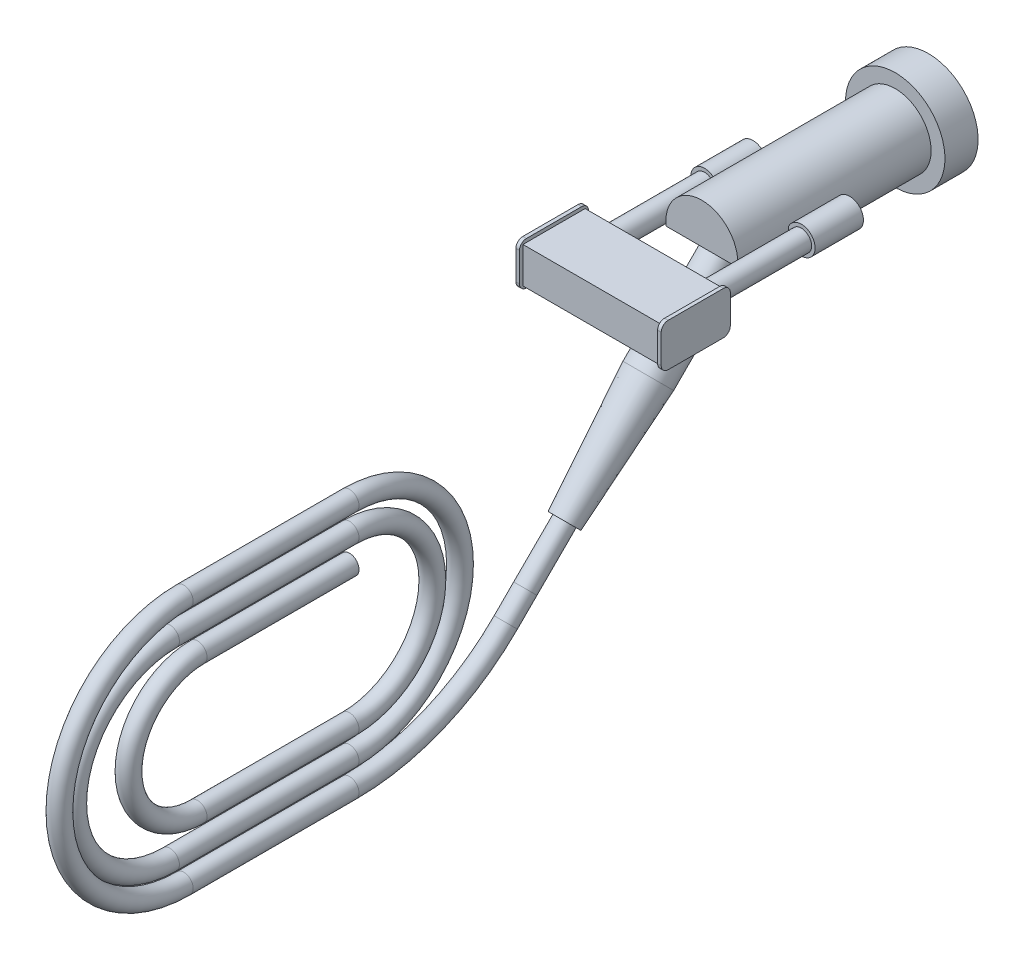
ISO-10303-21;
HEADER;
FILE_DESCRIPTION(('STEP AP214'),'2;1');
FILE_NAME('part.step','',(''),(''),'','','');
FILE_SCHEMA(('AUTOMOTIVE_DESIGN { 1 0 10303 214 1 1 1 1 }'));
ENDSEC;
DATA;
#1=APPLICATION_CONTEXT('core data for automotive mechanical design processes');
#2=APPLICATION_PROTOCOL_DEFINITION('international standard','automotive_design',2000,#1);
#3=PRODUCT_CONTEXT('',#1,'mechanical');
#4=PRODUCT('Part','Part','',(#3));
#5=PRODUCT_RELATED_PRODUCT_CATEGORY('part','',(#4));
#6=PRODUCT_DEFINITION_FORMATION('','',#4);
#7=PRODUCT_DEFINITION_CONTEXT('part definition',#1,'design');
#8=PRODUCT_DEFINITION('design','',#6,#7);
#9=PRODUCT_DEFINITION_SHAPE('','',#8);
#10=(LENGTH_UNIT() NAMED_UNIT(*) SI_UNIT(.MILLI.,.METRE.));
#11=(NAMED_UNIT(*) PLANE_ANGLE_UNIT() SI_UNIT($,.RADIAN.));
#12=(NAMED_UNIT(*) SI_UNIT($,.STERADIAN.) SOLID_ANGLE_UNIT());
#13=UNCERTAINTY_MEASURE_WITH_UNIT(LENGTH_MEASURE(1.E-05),#10,'distance_accuracy_value','');
#14=(GEOMETRIC_REPRESENTATION_CONTEXT(3) GLOBAL_UNCERTAINTY_ASSIGNED_CONTEXT((#13)) GLOBAL_UNIT_ASSIGNED_CONTEXT((#10,
#11,#12)) REPRESENTATION_CONTEXT('',''));
#15=CARTESIAN_POINT('',(0.,0.,0.));
#16=DIRECTION('',(0.,0.,1.));
#17=DIRECTION('',(1.,0.,0.));
#18=AXIS2_PLACEMENT_3D('',#15,#16,#17);
#19=CARTESIAN_POINT('',(0.,-195.094904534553,370.578881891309));
#20=DIRECTION('',(0.,-0.707106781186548,0.707106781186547));
#21=DIRECTION('',(0.,-0.707106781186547,-0.707106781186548));
#22=AXIS2_PLACEMENT_3D('',#19,#20,#21);
#23=CIRCLE('',#22,8.73125);
#24=DIRECTION('',(0.,0.704898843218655,-0.709307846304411));
#25=VECTOR('',#24,1.);
#26=SURFACE_OF_LINEAR_EXTRUSION('',#23,#25);
#27=CARTESIAN_POINT('',(0.,-195.094904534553,370.578881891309));
#28=DIRECTION('',(0.,0.707106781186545,-0.70710678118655));
#29=DIRECTION('',(0.,0.70710678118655,0.707106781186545));
#30=AXIS2_PLACEMENT_3D('',#27,#28,#29);
#31=CIRCLE('',#30,8.73125000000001);
#32=CARTESIAN_POINT('',(0.,-188.920978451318,376.752807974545));
#33=VERTEX_POINT('',#32);
#34=EDGE_CURVE('E11',#33,#33,#31,.F.);
#35=ORIENTED_EDGE('',*,*,#34,.F.);
#36=EDGE_LOOP('',(#35));
#37=FACE_BOUND('',#36,.T.);
#38=CARTESIAN_POINT('',(0.,-159.286043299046,334.546043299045));
#39=DIRECTION('',(0.,-0.707106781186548,0.707106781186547));
#40=DIRECTION('',(0.,-0.707106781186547,-0.707106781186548));
#41=AXIS2_PLACEMENT_3D('',#38,#39,#40);
#42=CIRCLE('',#41,8.73125);
#43=CARTESIAN_POINT('',(0.,-165.459969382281,328.37211721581));
#44=VERTEX_POINT('',#43);
#45=EDGE_CURVE('E43',#44,#44,#42,.T.);
#46=ORIENTED_EDGE('',*,*,#45,.T.);
#47=EDGE_LOOP('',(#46));
#48=FACE_BOUND('',#47,.T.);
#49=ADVANCED_FACE('F35',(#37,#48),#26,.F.);
#50=CARTESIAN_POINT('',(0.,-159.286043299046,334.546043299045));
#51=DIRECTION('',(0.,-0.707106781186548,0.707106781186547));
#52=DIRECTION('',(0.,-0.707106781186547,-0.707106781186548));
#53=AXIS2_PLACEMENT_3D('',#50,#51,#52);
#54=PLANE('',#53);
#55=ORIENTED_EDGE('',*,*,#45,.F.);
#56=EDGE_LOOP('',(#55));
#57=FACE_BOUND('',#56,.T.);
#58=ADVANCED_FACE('F106',(#57),#54,.F.);
#59=CARTESIAN_POINT('',(0.,-94.7713188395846,671.923492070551));
#60=DIRECTION('',(0.,0.,-1.));
#61=DIRECTION('',(0.,1.,0.));
#62=AXIS2_PLACEMENT_3D('',#59,#60,#61);
#63=CYLINDRICAL_SURFACE('',#62,8.73125000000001);
#64=CARTESIAN_POINT('',(0.,-94.7713188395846,671.923492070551));
#65=DIRECTION('',(0.,0.,-1.));
#66=DIRECTION('',(0.,1.,0.));
#67=AXIS2_PLACEMENT_3D('',#64,#65,#66);
#68=CIRCLE('',#67,8.73125000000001);
#69=CARTESIAN_POINT('',(0.,-86.0400688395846,671.923492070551));
#70=VERTEX_POINT('',#69);
#71=EDGE_CURVE('E53',#70,#70,#68,.T.);
#72=ORIENTED_EDGE('',*,*,#71,.T.);
#73=EDGE_LOOP('',(#72));
#74=FACE_BOUND('',#73,.T.);
#75=CARTESIAN_POINT('',(0.,-94.7713188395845,532.223492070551));
#76=DIRECTION('',(0.,0.,-1.));
#77=DIRECTION('',(0.,1.,0.));
#78=AXIS2_PLACEMENT_3D('',#75,#76,#77);
#79=CIRCLE('',#78,8.73125000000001);
#80=CARTESIAN_POINT('',(0.,-86.0400688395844,532.223492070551));
#81=VERTEX_POINT('',#80);
#82=EDGE_CURVE('E47',#81,#81,#79,.T.);
#83=ORIENTED_EDGE('',*,*,#82,.F.);
#84=EDGE_LOOP('',(#83));
#85=FACE_BOUND('',#84,.T.);
#86=ADVANCED_FACE('F112',(#74,#85),#63,.T.);
#87=CARTESIAN_POINT('',(0.,-158.271318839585,671.923492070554));
#88=DIRECTION('',(-1.,0.,0.));
#89=DIRECTION('',(0.,0.,1.));
#90=AXIS2_PLACEMENT_3D('',#87,#88,#89);
#91=TOROIDAL_SURFACE('',#90,63.5000000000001,8.73125000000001);
#92=CARTESIAN_POINT('',(0.,-221.771318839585,671.923492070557));
#93=DIRECTION('',(0.,0.,1.));
#94=DIRECTION('',(0.,-1.,0.));
#95=AXIS2_PLACEMENT_3D('',#92,#93,#94);
#96=CIRCLE('',#95,8.73125000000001);
#97=CARTESIAN_POINT('',(0.,-230.502568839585,671.923492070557));
#98=VERTEX_POINT('',#97);
#99=EDGE_CURVE('E56',#98,#98,#96,.T.);
#100=CARTESIAN_POINT('',(0.,-158.271318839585,671.923492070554));
#101=DIRECTION('',(-1.,0.,0.));
#102=DIRECTION('',(0.,0.,1.));
#103=AXIS2_PLACEMENT_3D('',#100,#101,#102);
#104=CIRCLE('',#103,72.2312500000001);
#105=EDGE_CURVE('',#98,#70,#104,.T.);
#106=ORIENTED_EDGE('',*,*,#99,.T.);
#107=ORIENTED_EDGE('',*,*,#71,.F.);
#108=ORIENTED_EDGE('',*,*,#105,.T.);
#109=ORIENTED_EDGE('',*,*,#105,.F.);
#110=EDGE_LOOP('',(#106,#108,#107,#109));
#111=FACE_BOUND('',#110,.T.);
#112=ADVANCED_FACE('F118',(#111),#91,.T.);
#113=CARTESIAN_POINT('',(0.,-221.771318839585,532.223492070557));
#114=DIRECTION('',(0.,0.,1.));
#115=DIRECTION('',(0.,-1.,0.));
#116=AXIS2_PLACEMENT_3D('',#113,#114,#115);
#117=CYLINDRICAL_SURFACE('',#116,8.73125000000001);
#118=CARTESIAN_POINT('',(0.,-221.771318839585,532.223492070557));
#119=DIRECTION('',(0.,0.,1.));
#120=DIRECTION('',(0.,-1.,0.));
#121=AXIS2_PLACEMENT_3D('',#118,#119,#120);
#122=CIRCLE('',#121,8.73125000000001);
#123=CARTESIAN_POINT('',(0.,-230.502568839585,532.223492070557));
#124=VERTEX_POINT('',#123);
#125=EDGE_CURVE('E59',#124,#124,#122,.T.);
#126=ORIENTED_EDGE('',*,*,#125,.T.);
#127=EDGE_LOOP('',(#126));
#128=FACE_BOUND('',#127,.T.);
#129=ORIENTED_EDGE('',*,*,#99,.F.);
#130=EDGE_LOOP('',(#129));
#131=FACE_BOUND('',#130,.T.);
#132=ADVANCED_FACE('F124',(#128,#131),#117,.T.);
#133=CARTESIAN_POINT('',(0.,-145.571318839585,532.223492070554));
#134=DIRECTION('',(-1.,0.,0.));
#135=DIRECTION('',(0.,0.,1.));
#136=AXIS2_PLACEMENT_3D('',#133,#134,#135);
#137=TOROIDAL_SURFACE('',#136,76.2000000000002,8.73125000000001);
#138=CARTESIAN_POINT('',(0.,-69.3713188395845,532.223492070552));
#139=DIRECTION('',(0.,0.,-1.));
#140=DIRECTION('',(0.,1.,0.));
#141=AXIS2_PLACEMENT_3D('',#138,#139,#140);
#142=CIRCLE('',#141,8.73125000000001);
#143=CARTESIAN_POINT('',(0.,-60.6400688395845,532.223492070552));
#144=VERTEX_POINT('',#143);
#145=EDGE_CURVE('E62',#144,#144,#142,.T.);
#146=CARTESIAN_POINT('',(0.,-145.571318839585,532.223492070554));
#147=DIRECTION('',(-1.,0.,0.));
#148=DIRECTION('',(0.,0.,1.));
#149=AXIS2_PLACEMENT_3D('',#146,#147,#148);
#150=CIRCLE('',#149,84.9312500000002);
#151=EDGE_CURVE('',#144,#124,#150,.T.);
#152=ORIENTED_EDGE('',*,*,#145,.T.);
#153=ORIENTED_EDGE('',*,*,#125,.F.);
#154=ORIENTED_EDGE('',*,*,#151,.T.);
#155=ORIENTED_EDGE('',*,*,#151,.F.);
#156=EDGE_LOOP('',(#152,#154,#153,#155));
#157=FACE_BOUND('',#156,.T.);
#158=ADVANCED_FACE('F128',(#157),#137,.T.);
#159=CARTESIAN_POINT('',(0.,-69.3713188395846,697.323492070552));
#160=DIRECTION('',(0.,0.,-1.));
#161=DIRECTION('',(0.,1.,0.));
#162=AXIS2_PLACEMENT_3D('',#159,#160,#161);
#163=CYLINDRICAL_SURFACE('',#162,8.73125000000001);
#164=CARTESIAN_POINT('',(0.,-69.3713188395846,697.323492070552));
#165=DIRECTION('',(0.,0.,-1.));
#166=DIRECTION('',(0.,1.,0.));
#167=AXIS2_PLACEMENT_3D('',#164,#165,#166);
#168=CIRCLE('',#167,8.73125000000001);
#169=CARTESIAN_POINT('',(0.,-60.6400688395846,697.323492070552));
#170=VERTEX_POINT('',#169);
#171=EDGE_CURVE('E65',#170,#170,#168,.T.);
#172=ORIENTED_EDGE('',*,*,#171,.T.);
#173=EDGE_LOOP('',(#172));
#174=FACE_BOUND('',#173,.T.);
#175=ORIENTED_EDGE('',*,*,#145,.F.);
#176=EDGE_LOOP('',(#175));
#177=FACE_BOUND('',#176,.T.);
#178=ADVANCED_FACE('F132',(#174,#177),#163,.T.);
#179=CARTESIAN_POINT('',(0.,-158.271318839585,697.323492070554));
#180=DIRECTION('',(-1.,0.,0.));
#181=DIRECTION('',(0.,0.,1.));
#182=AXIS2_PLACEMENT_3D('',#179,#180,#181);
#183=TOROIDAL_SURFACE('',#182,88.9000000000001,8.73125000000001);
#184=CARTESIAN_POINT('',(0.,-247.171318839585,697.323492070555));
#185=DIRECTION('',(0.,0.,1.));
#186=DIRECTION('',(0.,-1.,0.));
#187=AXIS2_PLACEMENT_3D('',#184,#185,#186);
#188=CIRCLE('',#187,8.73125000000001);
#189=CARTESIAN_POINT('',(0.,-255.902568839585,697.323492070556));
#190=VERTEX_POINT('',#189);
#191=EDGE_CURVE('E68',#190,#190,#188,.T.);
#192=CARTESIAN_POINT('',(0.,-158.271318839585,697.323492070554));
#193=DIRECTION('',(-1.,0.,0.));
#194=DIRECTION('',(0.,0.,1.));
#195=AXIS2_PLACEMENT_3D('',#192,#193,#194);
#196=CIRCLE('',#195,97.6312500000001);
#197=EDGE_CURVE('',#190,#170,#196,.T.);
#198=ORIENTED_EDGE('',*,*,#191,.T.);
#199=ORIENTED_EDGE('',*,*,#171,.F.);
#200=ORIENTED_EDGE('',*,*,#197,.T.);
#201=ORIENTED_EDGE('',*,*,#197,.F.);
#202=EDGE_LOOP('',(#198,#200,#199,#201));
#203=FACE_BOUND('',#202,.T.);
#204=ADVANCED_FACE('F136',(#203),#183,.T.);
#205=CARTESIAN_POINT('',(0.,-247.171318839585,532.223492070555));
#206=DIRECTION('',(0.,0.,1.));
#207=DIRECTION('',(0.,-1.,0.));
#208=AXIS2_PLACEMENT_3D('',#205,#206,#207);
#209=CYLINDRICAL_SURFACE('',#208,8.73125000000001);
#210=CARTESIAN_POINT('',(0.,-247.171318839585,532.223492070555));
#211=DIRECTION('',(0.,0.,1.));
#212=DIRECTION('',(0.,-1.,0.));
#213=AXIS2_PLACEMENT_3D('',#210,#211,#212);
#214=CIRCLE('',#213,8.73125000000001);
#215=CARTESIAN_POINT('',(0.,-255.902568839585,532.223492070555));
#216=VERTEX_POINT('',#215);
#217=EDGE_CURVE('E71',#216,#216,#214,.T.);
#218=ORIENTED_EDGE('',*,*,#217,.T.);
#219=EDGE_LOOP('',(#218));
#220=FACE_BOUND('',#219,.T.);
#221=ORIENTED_EDGE('',*,*,#191,.F.);
#222=EDGE_LOOP('',(#221));
#223=FACE_BOUND('',#222,.T.);
#224=ADVANCED_FACE('F140',(#220,#223),#209,.T.);
#225=CARTESIAN_POINT('',(0.,-145.571318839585,532.223492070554));
#226=DIRECTION('',(-1.,0.,0.));
#227=DIRECTION('',(0.,0.,1.));
#228=AXIS2_PLACEMENT_3D('',#225,#226,#227);
#229=TOROIDAL_SURFACE('',#228,101.6,8.73125000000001);
#230=CARTESIAN_POINT('',(0.,-43.9713188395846,532.223492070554));
#231=DIRECTION('',(0.,0.,-1.));
#232=DIRECTION('',(0.,1.,0.));
#233=AXIS2_PLACEMENT_3D('',#230,#231,#232);
#234=CIRCLE('',#233,8.73125000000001);
#235=CARTESIAN_POINT('',(0.,-35.2400688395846,532.223492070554));
#236=VERTEX_POINT('',#235);
#237=EDGE_CURVE('E74',#236,#236,#234,.T.);
#238=CARTESIAN_POINT('',(0.,-145.571318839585,532.223492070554));
#239=DIRECTION('',(-1.,0.,0.));
#240=DIRECTION('',(0.,0.,1.));
#241=AXIS2_PLACEMENT_3D('',#238,#239,#240);
#242=CIRCLE('',#241,110.33125);
#243=EDGE_CURVE('',#236,#216,#242,.T.);
#244=ORIENTED_EDGE('',*,*,#237,.T.);
#245=ORIENTED_EDGE('',*,*,#217,.F.);
#246=ORIENTED_EDGE('',*,*,#243,.T.);
#247=ORIENTED_EDGE('',*,*,#243,.F.);
#248=EDGE_LOOP('',(#244,#246,#245,#247));
#249=FACE_BOUND('',#248,.T.);
#250=ADVANCED_FACE('F144',(#249),#229,.T.);
#251=CARTESIAN_POINT('',(0.,-43.9713188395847,684.623492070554));
#252=DIRECTION('',(0.,0.,-1.));
#253=DIRECTION('',(0.,1.,0.));
#254=AXIS2_PLACEMENT_3D('',#251,#252,#253);
#255=CYLINDRICAL_SURFACE('',#254,8.73125000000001);
#256=CARTESIAN_POINT('',(0.,-43.9713188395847,684.623492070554));
#257=DIRECTION('',(0.,0.,-1.));
#258=DIRECTION('',(0.,1.,0.));
#259=AXIS2_PLACEMENT_3D('',#256,#257,#258);
#260=CIRCLE('',#259,8.73125000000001);
#261=CARTESIAN_POINT('',(0.,-35.2400688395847,684.623492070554));
#262=VERTEX_POINT('',#261);
#263=EDGE_CURVE('E77',#262,#262,#260,.T.);
#264=ORIENTED_EDGE('',*,*,#263,.T.);
#265=EDGE_LOOP('',(#264));
#266=FACE_BOUND('',#265,.T.);
#267=ORIENTED_EDGE('',*,*,#237,.F.);
#268=EDGE_LOOP('',(#267));
#269=FACE_BOUND('',#268,.T.);
#270=ADVANCED_FACE('F148',(#266,#269),#255,.T.);
#271=CARTESIAN_POINT('',(0.,-158.271318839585,684.623492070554));
#272=DIRECTION('',(-1.,0.,0.));
#273=DIRECTION('',(0.,0.,1.));
#274=AXIS2_PLACEMENT_3D('',#271,#272,#273);
#275=TOROIDAL_SURFACE('',#274,114.3,8.73125000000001);
#276=CARTESIAN_POINT('',(0.,-272.571318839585,684.623492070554));
#277=DIRECTION('',(0.,0.,1.));
#278=DIRECTION('',(0.,-1.,0.));
#279=AXIS2_PLACEMENT_3D('',#276,#277,#278);
#280=CIRCLE('',#279,8.73125000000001);
#281=CARTESIAN_POINT('',(0.,-281.302568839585,684.623492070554));
#282=VERTEX_POINT('',#281);
#283=EDGE_CURVE('E80',#282,#282,#280,.T.);
#284=CARTESIAN_POINT('',(0.,-158.271318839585,684.623492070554));
#285=DIRECTION('',(-1.,0.,0.));
#286=DIRECTION('',(0.,0.,1.));
#287=AXIS2_PLACEMENT_3D('',#284,#285,#286);
#288=CIRCLE('',#287,123.03125);
#289=EDGE_CURVE('',#282,#262,#288,.T.);
#290=ORIENTED_EDGE('',*,*,#283,.T.);
#291=ORIENTED_EDGE('',*,*,#263,.F.);
#292=ORIENTED_EDGE('',*,*,#289,.T.);
#293=ORIENTED_EDGE('',*,*,#289,.F.);
#294=EDGE_LOOP('',(#290,#292,#291,#293));
#295=FACE_BOUND('',#294,.T.);
#296=ADVANCED_FACE('F152',(#295),#275,.T.);
#297=CARTESIAN_POINT('',(0.,-272.571318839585,532.223492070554));
#298=DIRECTION('',(0.,0.,1.));
#299=DIRECTION('',(0.,-1.,0.));
#300=AXIS2_PLACEMENT_3D('',#297,#298,#299);
#301=CYLINDRICAL_SURFACE('',#300,8.73125000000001);
#302=CARTESIAN_POINT('',(0.,-272.571318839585,532.223492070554));
#303=DIRECTION('',(0.,0.,1.));
#304=DIRECTION('',(0.,-1.,0.));
#305=AXIS2_PLACEMENT_3D('',#302,#303,#304);
#306=CIRCLE('',#305,8.73125000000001);
#307=CARTESIAN_POINT('',(0.,-281.302568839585,532.223492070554));
#308=VERTEX_POINT('',#307);
#309=EDGE_CURVE('E83',#308,#308,#306,.T.);
#310=ORIENTED_EDGE('',*,*,#309,.T.);
#311=EDGE_LOOP('',(#310));
#312=FACE_BOUND('',#311,.T.);
#313=ORIENTED_EDGE('',*,*,#283,.F.);
#314=EDGE_LOOP('',(#313));
#315=FACE_BOUND('',#314,.T.);
#316=ADVANCED_FACE('F103',(#312,#315),#301,.T.);
#317=CARTESIAN_POINT('',(0.,-69.3713188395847,532.223492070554));
#318=DIRECTION('',(-1.,0.,0.));
#319=DIRECTION('',(0.,0.,1.));
#320=AXIS2_PLACEMENT_3D('',#317,#318,#319);
#321=TOROIDAL_SURFACE('',#320,203.2,8.73125000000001);
#322=CARTESIAN_POINT('',(0.,-213.055416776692,388.539394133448));
#323=DIRECTION('',(0.,-0.707106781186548,0.707106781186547));
#324=DIRECTION('',(0.,-0.707106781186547,-0.707106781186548));
#325=AXIS2_PLACEMENT_3D('',#322,#323,#324);
#326=CIRCLE('',#325,8.73125000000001);
#327=CARTESIAN_POINT('',(0.,-219.229342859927,382.365468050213));
#328=VERTEX_POINT('',#327);
#329=EDGE_CURVE('E86',#328,#328,#326,.T.);
#330=CARTESIAN_POINT('',(0.,-69.3713188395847,532.223492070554));
#331=DIRECTION('',(-1.,0.,0.));
#332=DIRECTION('',(0.,0.,1.));
#333=AXIS2_PLACEMENT_3D('',#330,#331,#332);
#334=CIRCLE('',#333,211.93125);
#335=EDGE_CURVE('',#328,#308,#334,.T.);
#336=ORIENTED_EDGE('',*,*,#329,.T.);
#337=ORIENTED_EDGE('',*,*,#309,.F.);
#338=ORIENTED_EDGE('',*,*,#335,.T.);
#339=ORIENTED_EDGE('',*,*,#335,.F.);
#340=EDGE_LOOP('',(#336,#338,#337,#339));
#341=FACE_BOUND('',#340,.T.);
#342=ADVANCED_FACE('F90',(#341),#321,.T.);
#343=CARTESIAN_POINT('',(0.,-213.055416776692,388.539394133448));
#344=DIRECTION('',(0.,0.707106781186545,-0.70710678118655));
#345=DIRECTION('',(0.,0.70710678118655,0.707106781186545));
#346=AXIS2_PLACEMENT_3D('',#343,#344,#345);
#347=CYLINDRICAL_SURFACE('',#346,8.73125000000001);
#348=ORIENTED_EDGE('',*,*,#329,.F.);
#349=EDGE_LOOP('',(#348));
#350=FACE_BOUND('',#349,.T.);
#351=ORIENTED_EDGE('',*,*,#34,.T.);
#352=EDGE_LOOP('',(#351));
#353=FACE_BOUND('',#352,.T.);
#354=ADVANCED_FACE('F93',(#350,#353),#347,.T.);
#355=CARTESIAN_POINT('',(0.,-94.7713188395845,532.223492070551));
#356=DIRECTION('',(0.,0.,-1.));
#357=DIRECTION('',(0.,1.,0.));
#358=AXIS2_PLACEMENT_3D('',#355,#356,#357);
#359=PLANE('',#358);
#360=ORIENTED_EDGE('',*,*,#82,.T.);
#361=EDGE_LOOP('',(#360));
#362=FACE_BOUND('',#361,.T.);
#363=ADVANCED_FACE('F95',(#362),#359,.T.);
#364=CLOSED_SHELL('',(#49,#58,#86,#112,#132,#158,#178,#204,#224,#250,#270,#296,#316,#342,#354,#363));
#365=MANIFOLD_SOLID_BREP('B2',#364);
#366=CARTESIAN_POINT('',(-66.802,13.335,306.07));
#367=DIRECTION('',(1.,0.,0.));
#368=DIRECTION('',(0.,0.,1.));
#369=AXIS2_PLACEMENT_3D('',#366,#367,#368);
#370=CYLINDRICAL_SURFACE('',#369,6.34999999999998);
#371=CARTESIAN_POINT('',(-63.5,13.335,306.07));
#372=DIRECTION('',(1.,0.,0.));
#373=DIRECTION('',(0.,0.,1.));
#374=AXIS2_PLACEMENT_3D('',#371,#372,#373);
#375=CIRCLE('',#374,6.34999999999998);
#376=CARTESIAN_POINT('',(-63.5,19.685,306.07));
#377=VERTEX_POINT('',#376);
#378=CARTESIAN_POINT('',(-63.5,13.335,312.42));
#379=VERTEX_POINT('',#378);
#380=EDGE_CURVE('E322',#377,#379,#375,.T.);
#381=ORIENTED_EDGE('',*,*,#380,.F.);
#382=DIRECTION('',(1.,0.,0.));
#383=VECTOR('',#382,1.);
#384=CARTESIAN_POINT('',(-66.802,19.685,306.07));
#385=LINE('',#384,#383);
#386=CARTESIAN_POINT('',(-66.802,19.685,306.07));
#387=VERTEX_POINT('',#386);
#388=EDGE_CURVE('E365',#387,#377,#385,.T.);
#389=ORIENTED_EDGE('',*,*,#388,.F.);
#390=CARTESIAN_POINT('',(-66.802,13.335,306.07));
#391=DIRECTION('',(1.,0.,0.));
#392=DIRECTION('',(0.,0.,1.));
#393=AXIS2_PLACEMENT_3D('',#390,#391,#392);
#394=CIRCLE('',#393,6.34999999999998);
#395=CARTESIAN_POINT('',(-66.802,13.335,312.42));
#396=VERTEX_POINT('',#395);
#397=EDGE_CURVE('E327',#387,#396,#394,.T.);
#398=ORIENTED_EDGE('',*,*,#397,.T.);
#399=DIRECTION('',(1.,0.,0.));
#400=VECTOR('',#399,1.);
#401=CARTESIAN_POINT('',(-66.802,13.335,312.42));
#402=LINE('',#401,#400);
#403=EDGE_CURVE('E33',#396,#379,#402,.T.);
#404=ORIENTED_EDGE('',*,*,#403,.T.);
#405=EDGE_LOOP('',(#381,#389,#398,#404));
#406=FACE_BOUND('',#405,.T.);
#407=ADVANCED_FACE('F250',(#406),#370,.T.);
#408=CARTESIAN_POINT('',(-66.802,13.335,312.42));
#409=DIRECTION('',(0.,0.,-1.));
#410=DIRECTION('',(1.,0.,0.));
#411=AXIS2_PLACEMENT_3D('',#408,#409,#410);
#412=PLANE('',#411);
#413=DIRECTION('',(0.,-1.,0.));
#414=VECTOR('',#413,1.);
#415=CARTESIAN_POINT('',(-63.5,13.335,312.42));
#416=LINE('',#415,#414);
#417=CARTESIAN_POINT('',(-63.5,-13.335,312.42));
#418=VERTEX_POINT('',#417);
#419=EDGE_CURVE('E313',#379,#418,#416,.T.);
#420=ORIENTED_EDGE('',*,*,#419,.F.);
#421=ORIENTED_EDGE('',*,*,#403,.F.);
#422=DIRECTION('',(0.,-1.,0.));
#423=VECTOR('',#422,1.);
#424=CARTESIAN_POINT('',(-66.802,13.335,312.42));
#425=LINE('',#424,#423);
#426=CARTESIAN_POINT('',(-66.802,-13.335,312.42));
#427=VERTEX_POINT('',#426);
#428=EDGE_CURVE('E347',#396,#427,#425,.T.);
#429=ORIENTED_EDGE('',*,*,#428,.T.);
#430=DIRECTION('',(1.,0.,0.));
#431=VECTOR('',#430,1.);
#432=CARTESIAN_POINT('',(-66.802,-13.335,312.42));
#433=LINE('',#432,#431);
#434=EDGE_CURVE('E257',#427,#418,#433,.T.);
#435=ORIENTED_EDGE('',*,*,#434,.T.);
#436=EDGE_LOOP('',(#420,#421,#429,#435));
#437=FACE_BOUND('',#436,.T.);
#438=ADVANCED_FACE('F314',(#437),#412,.F.);
#439=CARTESIAN_POINT('',(-66.802,-13.335,306.07));
#440=DIRECTION('',(1.,0.,0.));
#441=DIRECTION('',(0.,0.,1.));
#442=AXIS2_PLACEMENT_3D('',#439,#440,#441);
#443=CYLINDRICAL_SURFACE('',#442,6.34999999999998);
#444=CARTESIAN_POINT('',(-63.5,-13.335,306.07));
#445=DIRECTION('',(1.,0.,0.));
#446=DIRECTION('',(0.,0.,-1.));
#447=AXIS2_PLACEMENT_3D('',#444,#445,#446);
#448=CIRCLE('',#447,6.34999999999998);
#449=CARTESIAN_POINT('',(-63.5,-19.685,306.07));
#450=VERTEX_POINT('',#449);
#451=EDGE_CURVE('E321',#418,#450,#448,.T.);
#452=ORIENTED_EDGE('',*,*,#451,.F.);
#453=ORIENTED_EDGE('',*,*,#434,.F.);
#454=CARTESIAN_POINT('',(-66.802,-13.335,306.07));
#455=DIRECTION('',(1.,0.,0.));
#456=DIRECTION('',(0.,0.,-1.));
#457=AXIS2_PLACEMENT_3D('',#454,#455,#456);
#458=CIRCLE('',#457,6.34999999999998);
#459=CARTESIAN_POINT('',(-66.802,-19.685,306.07));
#460=VERTEX_POINT('',#459);
#461=EDGE_CURVE('E349',#427,#460,#458,.T.);
#462=ORIENTED_EDGE('',*,*,#461,.T.);
#463=DIRECTION('',(1.,0.,0.));
#464=VECTOR('',#463,1.);
#465=CARTESIAN_POINT('',(-66.802,-19.685,306.07));
#466=LINE('',#465,#464);
#467=EDGE_CURVE('E379',#460,#450,#466,.T.);
#468=ORIENTED_EDGE('',*,*,#467,.T.);
#469=EDGE_LOOP('',(#452,#453,#462,#468));
#470=FACE_BOUND('',#469,.T.);
#471=ADVANCED_FACE('F383',(#470),#443,.T.);
#472=CARTESIAN_POINT('',(-66.802,-19.685,306.07));
#473=DIRECTION('',(0.,1.,0.));
#474=DIRECTION('',(0.,0.,1.));
#475=AXIS2_PLACEMENT_3D('',#472,#473,#474);
#476=PLANE('',#475);
#477=DIRECTION('',(0.,0.,-1.));
#478=VECTOR('',#477,1.);
#479=CARTESIAN_POINT('',(-63.5,-19.685,306.07));
#480=LINE('',#479,#478);
#481=CARTESIAN_POINT('',(-63.5,-19.685,255.27));
#482=VERTEX_POINT('',#481);
#483=EDGE_CURVE('E334',#450,#482,#480,.T.);
#484=ORIENTED_EDGE('',*,*,#483,.F.);
#485=ORIENTED_EDGE('',*,*,#467,.F.);
#486=DIRECTION('',(0.,0.,-1.));
#487=VECTOR('',#486,1.);
#488=CARTESIAN_POINT('',(-66.802,-19.685,306.07));
#489=LINE('',#488,#487);
#490=CARTESIAN_POINT('',(-66.802,-19.685,255.27));
#491=VERTEX_POINT('',#490);
#492=EDGE_CURVE('E352',#460,#491,#489,.T.);
#493=ORIENTED_EDGE('',*,*,#492,.T.);
#494=DIRECTION('',(1.,0.,0.));
#495=VECTOR('',#494,1.);
#496=CARTESIAN_POINT('',(-66.802,-19.685,255.27));
#497=LINE('',#496,#495);
#498=EDGE_CURVE('E376',#491,#482,#497,.T.);
#499=ORIENTED_EDGE('',*,*,#498,.T.);
#500=EDGE_LOOP('',(#484,#485,#493,#499));
#501=FACE_BOUND('',#500,.T.);
#502=ADVANCED_FACE('F385',(#501),#476,.F.);
#503=CARTESIAN_POINT('',(-66.802,-13.335,255.27));
#504=DIRECTION('',(1.,0.,0.));
#505=DIRECTION('',(0.,0.,1.));
#506=AXIS2_PLACEMENT_3D('',#503,#504,#505);
#507=CYLINDRICAL_SURFACE('',#506,6.35000000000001);
#508=CARTESIAN_POINT('',(-63.5,-13.335,255.27));
#509=DIRECTION('',(1.,0.,0.));
#510=DIRECTION('',(0.,0.,1.));
#511=AXIS2_PLACEMENT_3D('',#508,#509,#510);
#512=CIRCLE('',#511,6.35000000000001);
#513=CARTESIAN_POINT('',(-63.5,-13.335,248.92));
#514=VERTEX_POINT('',#513);
#515=EDGE_CURVE('E337',#482,#514,#512,.T.);
#516=ORIENTED_EDGE('',*,*,#515,.F.);
#517=ORIENTED_EDGE('',*,*,#498,.F.);
#518=CARTESIAN_POINT('',(-66.802,-13.335,255.27));
#519=DIRECTION('',(1.,0.,0.));
#520=DIRECTION('',(0.,0.,1.));
#521=AXIS2_PLACEMENT_3D('',#518,#519,#520);
#522=CIRCLE('',#521,6.35000000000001);
#523=CARTESIAN_POINT('',(-66.802,-13.335,248.92));
#524=VERTEX_POINT('',#523);
#525=EDGE_CURVE('E355',#491,#524,#522,.T.);
#526=ORIENTED_EDGE('',*,*,#525,.T.);
#527=DIRECTION('',(1.,0.,0.));
#528=VECTOR('',#527,1.);
#529=CARTESIAN_POINT('',(-66.802,-13.335,248.92));
#530=LINE('',#529,#528);
#531=EDGE_CURVE('E373',#524,#514,#530,.T.);
#532=ORIENTED_EDGE('',*,*,#531,.T.);
#533=EDGE_LOOP('',(#516,#517,#526,#532));
#534=FACE_BOUND('',#533,.T.);
#535=ADVANCED_FACE('F388',(#534),#507,.T.);
#536=CARTESIAN_POINT('',(-66.802,-13.335,248.92));
#537=DIRECTION('',(0.,0.,1.));
#538=DIRECTION('',(-1.,0.,0.));
#539=AXIS2_PLACEMENT_3D('',#536,#537,#538);
#540=PLANE('',#539);
#541=DIRECTION('',(0.,1.,0.));
#542=VECTOR('',#541,1.);
#543=CARTESIAN_POINT('',(-63.5,-13.335,248.92));
#544=LINE('',#543,#542);
#545=CARTESIAN_POINT('',(-63.5,13.335,248.92));
#546=VERTEX_POINT('',#545);
#547=EDGE_CURVE('E340',#514,#546,#544,.T.);
#548=ORIENTED_EDGE('',*,*,#547,.F.);
#549=ORIENTED_EDGE('',*,*,#531,.F.);
#550=DIRECTION('',(0.,1.,0.));
#551=VECTOR('',#550,1.);
#552=CARTESIAN_POINT('',(-66.802,-13.335,248.92));
#553=LINE('',#552,#551);
#554=CARTESIAN_POINT('',(-66.802,13.335,248.92));
#555=VERTEX_POINT('',#554);
#556=EDGE_CURVE('E358',#524,#555,#553,.T.);
#557=ORIENTED_EDGE('',*,*,#556,.T.);
#558=DIRECTION('',(1.,0.,0.));
#559=VECTOR('',#558,1.);
#560=CARTESIAN_POINT('',(-66.802,13.335,248.92));
#561=LINE('',#560,#559);
#562=EDGE_CURVE('E370',#555,#546,#561,.T.);
#563=ORIENTED_EDGE('',*,*,#562,.T.);
#564=EDGE_LOOP('',(#548,#549,#557,#563));
#565=FACE_BOUND('',#564,.T.);
#566=ADVANCED_FACE('F391',(#565),#540,.F.);
#567=CARTESIAN_POINT('',(-66.802,13.335,255.27));
#568=DIRECTION('',(1.,0.,0.));
#569=DIRECTION('',(0.,0.,1.));
#570=AXIS2_PLACEMENT_3D('',#567,#568,#569);
#571=CYLINDRICAL_SURFACE('',#570,6.35000000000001);
#572=CARTESIAN_POINT('',(-63.5,13.335,255.27));
#573=DIRECTION('',(1.,0.,0.));
#574=DIRECTION('',(0.,0.,1.));
#575=AXIS2_PLACEMENT_3D('',#572,#573,#574);
#576=CIRCLE('',#575,6.35000000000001);
#577=CARTESIAN_POINT('',(-63.5,19.685,255.27));
#578=VERTEX_POINT('',#577);
#579=EDGE_CURVE('E343',#546,#578,#576,.T.);
#580=ORIENTED_EDGE('',*,*,#579,.F.);
#581=ORIENTED_EDGE('',*,*,#562,.F.);
#582=CARTESIAN_POINT('',(-66.802,13.335,255.27));
#583=DIRECTION('',(1.,0.,0.));
#584=DIRECTION('',(0.,0.,1.));
#585=AXIS2_PLACEMENT_3D('',#582,#583,#584);
#586=CIRCLE('',#585,6.35000000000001);
#587=CARTESIAN_POINT('',(-66.802,19.685,255.27));
#588=VERTEX_POINT('',#587);
#589=EDGE_CURVE('E361',#555,#588,#586,.T.);
#590=ORIENTED_EDGE('',*,*,#589,.T.);
#591=DIRECTION('',(1.,0.,0.));
#592=VECTOR('',#591,1.);
#593=CARTESIAN_POINT('',(-66.802,19.685,255.27));
#594=LINE('',#593,#592);
#595=EDGE_CURVE('E367',#588,#578,#594,.T.);
#596=ORIENTED_EDGE('',*,*,#595,.T.);
#597=EDGE_LOOP('',(#580,#581,#590,#596));
#598=FACE_BOUND('',#597,.T.);
#599=ADVANCED_FACE('F394',(#598),#571,.T.);
#600=CARTESIAN_POINT('',(-66.802,19.685,255.27));
#601=DIRECTION('',(0.,-1.,0.));
#602=DIRECTION('',(0.,0.,-1.));
#603=AXIS2_PLACEMENT_3D('',#600,#601,#602);
#604=PLANE('',#603);
#605=DIRECTION('',(0.,0.,1.));
#606=VECTOR('',#605,1.);
#607=CARTESIAN_POINT('',(-63.5,19.685,255.27));
#608=LINE('',#607,#606);
#609=EDGE_CURVE('E330',#578,#377,#608,.T.);
#610=ORIENTED_EDGE('',*,*,#609,.F.);
#611=ORIENTED_EDGE('',*,*,#595,.F.);
#612=DIRECTION('',(0.,0.,1.));
#613=VECTOR('',#612,1.);
#614=CARTESIAN_POINT('',(-66.802,19.685,255.27));
#615=LINE('',#614,#613);
#616=EDGE_CURVE('E264',#588,#387,#615,.T.);
#617=ORIENTED_EDGE('',*,*,#616,.T.);
#618=ORIENTED_EDGE('',*,*,#388,.T.);
#619=EDGE_LOOP('',(#610,#611,#617,#618));
#620=FACE_BOUND('',#619,.T.);
#621=ADVANCED_FACE('F395',(#620),#604,.F.);
#622=CARTESIAN_POINT('',(-66.802,13.335,306.07));
#623=DIRECTION('',(1.,0.,0.));
#624=DIRECTION('',(0.,0.,1.));
#625=AXIS2_PLACEMENT_3D('',#622,#623,#624);
#626=PLANE('',#625);
#627=ORIENTED_EDGE('',*,*,#397,.F.);
#628=ORIENTED_EDGE('',*,*,#616,.F.);
#629=ORIENTED_EDGE('',*,*,#589,.F.);
#630=ORIENTED_EDGE('',*,*,#556,.F.);
#631=ORIENTED_EDGE('',*,*,#525,.F.);
#632=ORIENTED_EDGE('',*,*,#492,.F.);
#633=ORIENTED_EDGE('',*,*,#461,.F.);
#634=ORIENTED_EDGE('',*,*,#428,.F.);
#635=EDGE_LOOP('',(#627,#628,#629,#630,#631,#632,#633,#634));
#636=FACE_BOUND('',#635,.T.);
#637=ADVANCED_FACE('F397',(#636),#626,.F.);
#638=CARTESIAN_POINT('',(-63.5,13.335,306.07));
#639=DIRECTION('',(1.,0.,0.));
#640=DIRECTION('',(0.,0.,1.));
#641=AXIS2_PLACEMENT_3D('',#638,#639,#640);
#642=PLANE('',#641);
#643=ORIENTED_EDGE('',*,*,#380,.T.);
#644=ORIENTED_EDGE('',*,*,#419,.T.);
#645=ORIENTED_EDGE('',*,*,#451,.T.);
#646=ORIENTED_EDGE('',*,*,#483,.T.);
#647=ORIENTED_EDGE('',*,*,#515,.T.);
#648=ORIENTED_EDGE('',*,*,#547,.T.);
#649=ORIENTED_EDGE('',*,*,#579,.T.);
#650=ORIENTED_EDGE('',*,*,#609,.T.);
#651=EDGE_LOOP('',(#643,#644,#645,#646,#647,#648,#649,#650));
#652=FACE_BOUND('',#651,.T.);
#653=ADVANCED_FACE('F328',(#652),#642,.T.);
#654=CLOSED_SHELL('',(#407,#438,#471,#502,#535,#566,#599,#621,#637,#653));
#655=MANIFOLD_SOLID_BREP('B6',#654);
#656=CARTESIAN_POINT('',(-44.45,0.,252.095));
#657=DIRECTION('',(0.,0.,-1.));
#658=DIRECTION('',(1.,0.,0.));
#659=AXIS2_PLACEMENT_3D('',#656,#657,#658);
#660=CYLINDRICAL_SURFACE('',#659,9.52500000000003);
#661=CARTESIAN_POINT('',(-44.45,0.,252.095));
#662=DIRECTION('',(0.,0.,-1.));
#663=DIRECTION('',(-1.,0.,0.));
#664=AXIS2_PLACEMENT_3D('',#661,#662,#663);
#665=CIRCLE('',#664,9.52500000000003);
#666=CARTESIAN_POINT('',(-53.975,0.,252.095));
#667=VERTEX_POINT('',#666);
#668=EDGE_CURVE('E249',#667,#667,#665,.T.);
#669=ORIENTED_EDGE('',*,*,#668,.T.);
#670=EDGE_LOOP('',(#669));
#671=FACE_BOUND('',#670,.T.);
#672=CARTESIAN_POINT('',(-44.45,0.,161.29));
#673=DIRECTION('',(0.,0.,-1.));
#674=DIRECTION('',(-1.,0.,0.));
#675=AXIS2_PLACEMENT_3D('',#672,#673,#674);
#676=CIRCLE('',#675,9.52500000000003);
#677=CARTESIAN_POINT('',(-53.975,0.,161.29));
#678=VERTEX_POINT('',#677);
#679=EDGE_CURVE('E471',#678,#678,#676,.T.);
#680=ORIENTED_EDGE('',*,*,#679,.F.);
#681=EDGE_LOOP('',(#680));
#682=FACE_BOUND('',#681,.T.);
#683=ADVANCED_FACE('F465',(#671,#682),#660,.T.);
#684=CARTESIAN_POINT('',(-44.45,0.,252.095));
#685=DIRECTION('',(0.,0.,1.));
#686=DIRECTION('',(-1.,0.,0.));
#687=AXIS2_PLACEMENT_3D('',#684,#685,#686);
#688=PLANE('',#687);
#689=ORIENTED_EDGE('',*,*,#668,.F.);
#690=EDGE_LOOP('',(#689));
#691=FACE_BOUND('',#690,.T.);
#692=ADVANCED_FACE('F480',(#691),#688,.T.);
#693=CARTESIAN_POINT('',(-44.45,0.,161.29));
#694=DIRECTION('',(0.,0.,1.));
#695=DIRECTION('',(-1.,0.,0.));
#696=AXIS2_PLACEMENT_3D('',#693,#694,#695);
#697=PLANE('',#696);
#698=ORIENTED_EDGE('',*,*,#679,.T.);
#699=EDGE_LOOP('',(#698));
#700=FACE_BOUND('',#699,.T.);
#701=ADVANCED_FACE('F477',(#700),#697,.F.);
#702=CLOSED_SHELL('',(#683,#692,#701));
#703=MANIFOLD_SOLID_BREP('B27',#702);
#704=CARTESIAN_POINT('',(-44.45,0.,161.29));
#705=DIRECTION('',(0.,0.,-1.));
#706=DIRECTION('',(1.,0.,0.));
#707=AXIS2_PLACEMENT_3D('',#704,#705,#706);
#708=CYLINDRICAL_SURFACE('',#707,12.7);
#709=CARTESIAN_POINT('',(-44.45,0.,161.29));
#710=DIRECTION('',(0.,0.,-1.));
#711=DIRECTION('',(-1.,0.,0.));
#712=AXIS2_PLACEMENT_3D('',#709,#710,#711);
#713=CIRCLE('',#712,12.7);
#714=CARTESIAN_POINT('',(-57.15,0.,161.29));
#715=VERTEX_POINT('',#714);
#716=EDGE_CURVE('E464',#715,#715,#713,.T.);
#717=ORIENTED_EDGE('',*,*,#716,.T.);
#718=EDGE_LOOP('',(#717));
#719=FACE_BOUND('',#718,.T.);
#720=CARTESIAN_POINT('',(-44.45,0.,116.84));
#721=DIRECTION('',(0.,0.,-1.));
#722=DIRECTION('',(-1.,0.,0.));
#723=AXIS2_PLACEMENT_3D('',#720,#721,#722);
#724=CIRCLE('',#723,12.7);
#725=CARTESIAN_POINT('',(-57.15,0.,116.84));
#726=VERTEX_POINT('',#725);
#727=EDGE_CURVE('E515',#726,#726,#724,.T.);
#728=ORIENTED_EDGE('',*,*,#727,.F.);
#729=EDGE_LOOP('',(#728));
#730=FACE_BOUND('',#729,.T.);
#731=ADVANCED_FACE('F509',(#719,#730),#708,.T.);
#732=CARTESIAN_POINT('',(-44.45,0.,161.29));
#733=DIRECTION('',(0.,0.,1.));
#734=DIRECTION('',(-1.,0.,0.));
#735=AXIS2_PLACEMENT_3D('',#732,#733,#734);
#736=PLANE('',#735);
#737=ORIENTED_EDGE('',*,*,#716,.F.);
#738=EDGE_LOOP('',(#737));
#739=FACE_BOUND('',#738,.T.);
#740=ADVANCED_FACE('F524',(#739),#736,.T.);
#741=CARTESIAN_POINT('',(-44.45,0.,116.84));
#742=DIRECTION('',(0.,0.,1.));
#743=DIRECTION('',(-1.,0.,0.));
#744=AXIS2_PLACEMENT_3D('',#741,#742,#743);
#745=PLANE('',#744);
#746=ORIENTED_EDGE('',*,*,#727,.T.);
#747=EDGE_LOOP('',(#746));
#748=FACE_BOUND('',#747,.T.);
#749=ADVANCED_FACE('F521',(#748),#745,.F.);
#750=CLOSED_SHELL('',(#731,#740,#749));
#751=MANIFOLD_SOLID_BREP('B244',#750);
#752=CARTESIAN_POINT('',(66.802,13.335,306.07));
#753=DIRECTION('',(-1.,0.,0.));
#754=DIRECTION('',(0.,0.,1.));
#755=AXIS2_PLACEMENT_3D('',#752,#753,#754);
#756=CYLINDRICAL_SURFACE('',#755,6.34999999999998);
#757=CARTESIAN_POINT('',(63.5,13.335,306.07));
#758=DIRECTION('',(1.,0.,0.));
#759=DIRECTION('',(0.,0.,1.));
#760=AXIS2_PLACEMENT_3D('',#757,#758,#759);
#761=CIRCLE('',#760,6.34999999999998);
#762=CARTESIAN_POINT('',(63.5,19.685,306.07));
#763=VERTEX_POINT('',#762);
#764=CARTESIAN_POINT('',(63.5,13.335,312.42));
#765=VERTEX_POINT('',#764);
#766=EDGE_CURVE('E621',#763,#765,#761,.T.);
#767=ORIENTED_EDGE('',*,*,#766,.T.);
#768=DIRECTION('',(-1.,0.,0.));
#769=VECTOR('',#768,1.);
#770=CARTESIAN_POINT('',(66.802,13.335,312.42));
#771=LINE('',#770,#769);
#772=CARTESIAN_POINT('',(66.802,13.335,312.42));
#773=VERTEX_POINT('',#772);
#774=EDGE_CURVE('E507',#773,#765,#771,.T.);
#775=ORIENTED_EDGE('',*,*,#774,.F.);
#776=CARTESIAN_POINT('',(66.802,13.335,306.07));
#777=DIRECTION('',(1.,0.,0.));
#778=DIRECTION('',(0.,0.,1.));
#779=AXIS2_PLACEMENT_3D('',#776,#777,#778);
#780=CIRCLE('',#779,6.34999999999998);
#781=CARTESIAN_POINT('',(66.802,19.685,306.07));
#782=VERTEX_POINT('',#781);
#783=EDGE_CURVE('E648',#782,#773,#780,.T.);
#784=ORIENTED_EDGE('',*,*,#783,.F.);
#785=DIRECTION('',(-1.,0.,0.));
#786=VECTOR('',#785,1.);
#787=CARTESIAN_POINT('',(66.802,19.685,306.07));
#788=LINE('',#787,#786);
#789=EDGE_CURVE('E634',#782,#763,#788,.T.);
#790=ORIENTED_EDGE('',*,*,#789,.T.);
#791=EDGE_LOOP('',(#767,#775,#784,#790));
#792=FACE_BOUND('',#791,.T.);
#793=ADVANCED_FACE('F553',(#792),#756,.T.);
#794=CARTESIAN_POINT('',(66.802,13.335,312.42));
#795=DIRECTION('',(0.,0.,-1.));
#796=DIRECTION('',(-1.,0.,0.));
#797=AXIS2_PLACEMENT_3D('',#794,#795,#796);
#798=PLANE('',#797);
#799=DIRECTION('',(0.,-1.,0.));
#800=VECTOR('',#799,1.);
#801=CARTESIAN_POINT('',(63.5,13.335,312.42));
#802=LINE('',#801,#800);
#803=CARTESIAN_POINT('',(63.5,-13.335,312.42));
#804=VERTEX_POINT('',#803);
#805=EDGE_CURVE('E617',#765,#804,#802,.T.);
#806=ORIENTED_EDGE('',*,*,#805,.T.);
#807=DIRECTION('',(-1.,0.,0.));
#808=VECTOR('',#807,1.);
#809=CARTESIAN_POINT('',(66.802,-13.335,312.42));
#810=LINE('',#809,#808);
#811=CARTESIAN_POINT('',(66.802,-13.335,312.42));
#812=VERTEX_POINT('',#811);
#813=EDGE_CURVE('E560',#812,#804,#810,.T.);
#814=ORIENTED_EDGE('',*,*,#813,.F.);
#815=DIRECTION('',(0.,-1.,0.));
#816=VECTOR('',#815,1.);
#817=CARTESIAN_POINT('',(66.802,13.335,312.42));
#818=LINE('',#817,#816);
#819=EDGE_CURVE('E630',#773,#812,#818,.T.);
#820=ORIENTED_EDGE('',*,*,#819,.F.);
#821=ORIENTED_EDGE('',*,*,#774,.T.);
#822=EDGE_LOOP('',(#806,#814,#820,#821));
#823=FACE_BOUND('',#822,.T.);
#824=ADVANCED_FACE('F629',(#823),#798,.F.);
#825=CARTESIAN_POINT('',(66.802,-13.335,306.07));
#826=DIRECTION('',(-1.,0.,0.));
#827=DIRECTION('',(0.,0.,1.));
#828=AXIS2_PLACEMENT_3D('',#825,#826,#827);
#829=CYLINDRICAL_SURFACE('',#828,6.34999999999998);
#830=CARTESIAN_POINT('',(63.5,-13.335,306.07));
#831=DIRECTION('',(1.,0.,0.));
#832=DIRECTION('',(0.,0.,-1.));
#833=AXIS2_PLACEMENT_3D('',#830,#831,#832);
#834=CIRCLE('',#833,6.34999999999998);
#835=CARTESIAN_POINT('',(63.5,-19.685,306.07));
#836=VERTEX_POINT('',#835);
#837=EDGE_CURVE('E623',#804,#836,#834,.T.);
#838=ORIENTED_EDGE('',*,*,#837,.T.);
#839=DIRECTION('',(-1.,0.,0.));
#840=VECTOR('',#839,1.);
#841=CARTESIAN_POINT('',(66.802,-19.685,306.07));
#842=LINE('',#841,#840);
#843=CARTESIAN_POINT('',(66.802,-19.685,306.07));
#844=VERTEX_POINT('',#843);
#845=EDGE_CURVE('E674',#844,#836,#842,.T.);
#846=ORIENTED_EDGE('',*,*,#845,.F.);
#847=CARTESIAN_POINT('',(66.802,-13.335,306.07));
#848=DIRECTION('',(1.,0.,0.));
#849=DIRECTION('',(0.,0.,-1.));
#850=AXIS2_PLACEMENT_3D('',#847,#848,#849);
#851=CIRCLE('',#850,6.34999999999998);
#852=EDGE_CURVE('E651',#812,#844,#851,.T.);
#853=ORIENTED_EDGE('',*,*,#852,.F.);
#854=ORIENTED_EDGE('',*,*,#813,.T.);
#855=EDGE_LOOP('',(#838,#846,#853,#854));
#856=FACE_BOUND('',#855,.T.);
#857=ADVANCED_FACE('F678',(#856),#829,.T.);
#858=CARTESIAN_POINT('',(66.802,-19.685,306.07));
#859=DIRECTION('',(0.,1.,0.));
#860=DIRECTION('',(0.,0.,1.));
#861=AXIS2_PLACEMENT_3D('',#858,#859,#860);
#862=PLANE('',#861);
#863=DIRECTION('',(0.,0.,-1.));
#864=VECTOR('',#863,1.);
#865=CARTESIAN_POINT('',(63.5,-19.685,306.07));
#866=LINE('',#865,#864);
#867=CARTESIAN_POINT('',(63.5,-19.685,255.27));
#868=VERTEX_POINT('',#867);
#869=EDGE_CURVE('E638',#836,#868,#866,.T.);
#870=ORIENTED_EDGE('',*,*,#869,.T.);
#871=DIRECTION('',(-1.,0.,0.));
#872=VECTOR('',#871,1.);
#873=CARTESIAN_POINT('',(66.802,-19.685,255.27));
#874=LINE('',#873,#872);
#875=CARTESIAN_POINT('',(66.802,-19.685,255.27));
#876=VERTEX_POINT('',#875);
#877=EDGE_CURVE('E671',#876,#868,#874,.T.);
#878=ORIENTED_EDGE('',*,*,#877,.F.);
#879=DIRECTION('',(0.,0.,-1.));
#880=VECTOR('',#879,1.);
#881=CARTESIAN_POINT('',(66.802,-19.685,306.07));
#882=LINE('',#881,#880);
#883=EDGE_CURVE('E653',#844,#876,#882,.T.);
#884=ORIENTED_EDGE('',*,*,#883,.F.);
#885=ORIENTED_EDGE('',*,*,#845,.T.);
#886=EDGE_LOOP('',(#870,#878,#884,#885));
#887=FACE_BOUND('',#886,.T.);
#888=ADVANCED_FACE('F686',(#887),#862,.F.);
#889=CARTESIAN_POINT('',(66.802,-13.335,255.27));
#890=DIRECTION('',(-1.,0.,0.));
#891=DIRECTION('',(0.,0.,1.));
#892=AXIS2_PLACEMENT_3D('',#889,#890,#891);
#893=CYLINDRICAL_SURFACE('',#892,6.35000000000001);
#894=CARTESIAN_POINT('',(63.5,-13.335,255.27));
#895=DIRECTION('',(1.,0.,0.));
#896=DIRECTION('',(0.,0.,1.));
#897=AXIS2_PLACEMENT_3D('',#894,#895,#896);
#898=CIRCLE('',#897,6.35000000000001);
#899=CARTESIAN_POINT('',(63.5,-13.335,248.92));
#900=VERTEX_POINT('',#899);
#901=EDGE_CURVE('E640',#868,#900,#898,.T.);
#902=ORIENTED_EDGE('',*,*,#901,.T.);
#903=DIRECTION('',(-1.,0.,0.));
#904=VECTOR('',#903,1.);
#905=CARTESIAN_POINT('',(66.802,-13.335,248.92));
#906=LINE('',#905,#904);
#907=CARTESIAN_POINT('',(66.802,-13.335,248.92));
#908=VERTEX_POINT('',#907);
#909=EDGE_CURVE('E668',#908,#900,#906,.T.);
#910=ORIENTED_EDGE('',*,*,#909,.F.);
#911=CARTESIAN_POINT('',(66.802,-13.335,255.27));
#912=DIRECTION('',(1.,0.,0.));
#913=DIRECTION('',(0.,0.,1.));
#914=AXIS2_PLACEMENT_3D('',#911,#912,#913);
#915=CIRCLE('',#914,6.35000000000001);
#916=EDGE_CURVE('E655',#876,#908,#915,.T.);
#917=ORIENTED_EDGE('',*,*,#916,.F.);
#918=ORIENTED_EDGE('',*,*,#877,.T.);
#919=EDGE_LOOP('',(#902,#910,#917,#918));
#920=FACE_BOUND('',#919,.T.);
#921=ADVANCED_FACE('F689',(#920),#893,.T.);
#922=CARTESIAN_POINT('',(66.802,-13.335,248.92));
#923=DIRECTION('',(0.,0.,1.));
#924=DIRECTION('',(1.,0.,0.));
#925=AXIS2_PLACEMENT_3D('',#922,#923,#924);
#926=PLANE('',#925);
#927=DIRECTION('',(0.,1.,0.));
#928=VECTOR('',#927,1.);
#929=CARTESIAN_POINT('',(63.5,-13.335,248.92));
#930=LINE('',#929,#928);
#931=CARTESIAN_POINT('',(63.5,13.335,248.92));
#932=VERTEX_POINT('',#931);
#933=EDGE_CURVE('E642',#900,#932,#930,.T.);
#934=ORIENTED_EDGE('',*,*,#933,.T.);
#935=DIRECTION('',(-1.,0.,0.));
#936=VECTOR('',#935,1.);
#937=CARTESIAN_POINT('',(66.802,13.335,248.92));
#938=LINE('',#937,#936);
#939=CARTESIAN_POINT('',(66.802,13.335,248.92));
#940=VERTEX_POINT('',#939);
#941=EDGE_CURVE('E665',#940,#932,#938,.T.);
#942=ORIENTED_EDGE('',*,*,#941,.F.);
#943=DIRECTION('',(0.,1.,0.));
#944=VECTOR('',#943,1.);
#945=CARTESIAN_POINT('',(66.802,-13.335,248.92));
#946=LINE('',#945,#944);
#947=EDGE_CURVE('E657',#908,#940,#946,.T.);
#948=ORIENTED_EDGE('',*,*,#947,.F.);
#949=ORIENTED_EDGE('',*,*,#909,.T.);
#950=EDGE_LOOP('',(#934,#942,#948,#949));
#951=FACE_BOUND('',#950,.T.);
#952=ADVANCED_FACE('F694',(#951),#926,.F.);
#953=CARTESIAN_POINT('',(66.802,13.335,255.27));
#954=DIRECTION('',(-1.,0.,0.));
#955=DIRECTION('',(0.,0.,1.));
#956=AXIS2_PLACEMENT_3D('',#953,#954,#955);
#957=CYLINDRICAL_SURFACE('',#956,6.35000000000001);
#958=CARTESIAN_POINT('',(63.5,13.335,255.27));
#959=DIRECTION('',(1.,0.,0.));
#960=DIRECTION('',(0.,0.,1.));
#961=AXIS2_PLACEMENT_3D('',#958,#959,#960);
#962=CIRCLE('',#961,6.35000000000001);
#963=CARTESIAN_POINT('',(63.5,19.685,255.27));
#964=VERTEX_POINT('',#963);
#965=EDGE_CURVE('E644',#932,#964,#962,.T.);
#966=ORIENTED_EDGE('',*,*,#965,.T.);
#967=DIRECTION('',(-1.,0.,0.));
#968=VECTOR('',#967,1.);
#969=CARTESIAN_POINT('',(66.802,19.685,255.27));
#970=LINE('',#969,#968);
#971=CARTESIAN_POINT('',(66.802,19.685,255.27));
#972=VERTEX_POINT('',#971);
#973=EDGE_CURVE('E662',#972,#964,#970,.T.);
#974=ORIENTED_EDGE('',*,*,#973,.F.);
#975=CARTESIAN_POINT('',(66.802,13.335,255.27));
#976=DIRECTION('',(1.,0.,0.));
#977=DIRECTION('',(0.,0.,1.));
#978=AXIS2_PLACEMENT_3D('',#975,#976,#977);
#979=CIRCLE('',#978,6.35000000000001);
#980=EDGE_CURVE('E572',#940,#972,#979,.T.);
#981=ORIENTED_EDGE('',*,*,#980,.F.);
#982=ORIENTED_EDGE('',*,*,#941,.T.);
#983=EDGE_LOOP('',(#966,#974,#981,#982));
#984=FACE_BOUND('',#983,.T.);
#985=ADVANCED_FACE('F697',(#984),#957,.T.);
#986=CARTESIAN_POINT('',(66.802,19.685,255.27));
#987=DIRECTION('',(0.,-1.,0.));
#988=DIRECTION('',(0.,0.,-1.));
#989=AXIS2_PLACEMENT_3D('',#986,#987,#988);
#990=PLANE('',#989);
#991=DIRECTION('',(0.,0.,1.));
#992=VECTOR('',#991,1.);
#993=CARTESIAN_POINT('',(63.5,19.685,255.27));
#994=LINE('',#993,#992);
#995=EDGE_CURVE('E646',#964,#763,#994,.T.);
#996=ORIENTED_EDGE('',*,*,#995,.T.);
#997=ORIENTED_EDGE('',*,*,#789,.F.);
#998=DIRECTION('',(0.,0.,1.));
#999=VECTOR('',#998,1.);
#1000=CARTESIAN_POINT('',(66.802,19.685,255.27));
#1001=LINE('',#1000,#999);
#1002=EDGE_CURVE('E567',#972,#782,#1001,.T.);
#1003=ORIENTED_EDGE('',*,*,#1002,.F.);
#1004=ORIENTED_EDGE('',*,*,#973,.T.);
#1005=EDGE_LOOP('',(#996,#997,#1003,#1004));
#1006=FACE_BOUND('',#1005,.T.);
#1007=ADVANCED_FACE('F699',(#1006),#990,.F.);
#1008=CARTESIAN_POINT('',(66.802,13.335,306.07));
#1009=DIRECTION('',(-1.,0.,0.));
#1010=DIRECTION('',(0.,0.,1.));
#1011=AXIS2_PLACEMENT_3D('',#1008,#1009,#1010);
#1012=PLANE('',#1011);
#1013=ORIENTED_EDGE('',*,*,#783,.T.);
#1014=ORIENTED_EDGE('',*,*,#819,.T.);
#1015=ORIENTED_EDGE('',*,*,#852,.T.);
#1016=ORIENTED_EDGE('',*,*,#883,.T.);
#1017=ORIENTED_EDGE('',*,*,#916,.T.);
#1018=ORIENTED_EDGE('',*,*,#947,.T.);
#1019=ORIENTED_EDGE('',*,*,#980,.T.);
#1020=ORIENTED_EDGE('',*,*,#1002,.T.);
#1021=EDGE_LOOP('',(#1013,#1014,#1015,#1016,#1017,#1018,#1019,#1020));
#1022=FACE_BOUND('',#1021,.T.);
#1023=ADVANCED_FACE('F681',(#1022),#1012,.F.);
#1024=CARTESIAN_POINT('',(63.5,13.335,306.07));
#1025=DIRECTION('',(-1.,0.,0.));
#1026=DIRECTION('',(0.,0.,1.));
#1027=AXIS2_PLACEMENT_3D('',#1024,#1025,#1026);
#1028=PLANE('',#1027);
#1029=ORIENTED_EDGE('',*,*,#766,.F.);
#1030=ORIENTED_EDGE('',*,*,#995,.F.);
#1031=ORIENTED_EDGE('',*,*,#965,.F.);
#1032=ORIENTED_EDGE('',*,*,#933,.F.);
#1033=ORIENTED_EDGE('',*,*,#901,.F.);
#1034=ORIENTED_EDGE('',*,*,#869,.F.);
#1035=ORIENTED_EDGE('',*,*,#837,.F.);
#1036=ORIENTED_EDGE('',*,*,#805,.F.);
#1037=EDGE_LOOP('',(#1029,#1030,#1031,#1032,#1033,#1034,#1035,#1036));
#1038=FACE_BOUND('',#1037,.T.);
#1039=ADVANCED_FACE('F618',(#1038),#1028,.T.);
#1040=CLOSED_SHELL('',(#793,#824,#857,#888,#921,#952,#985,#1007,#1023,#1039));
#1041=MANIFOLD_SOLID_BREP('B459',#1040);
#1042=CARTESIAN_POINT('',(-63.5,-16.51,309.245));
#1043=DIRECTION('',(1.,0.,0.));
#1044=DIRECTION('',(0.,0.,-1.));
#1045=AXIS2_PLACEMENT_3D('',#1042,#1043,#1044);
#1046=PLANE('',#1045);
#1047=DIRECTION('',(0.,-1.,0.));
#1048=VECTOR('',#1047,1.);
#1049=CARTESIAN_POINT('',(-63.5,-16.51,252.095));
#1050=LINE('',#1049,#1048);
#1051=CARTESIAN_POINT('',(-63.5,16.51,252.095));
#1052=VERTEX_POINT('',#1051);
#1053=CARTESIAN_POINT('',(-63.5,-16.51,252.095));
#1054=VERTEX_POINT('',#1053);
#1055=EDGE_CURVE('E812',#1052,#1054,#1050,.T.);
#1056=ORIENTED_EDGE('',*,*,#1055,.T.);
#1057=DIRECTION('',(0.,0.,-1.));
#1058=VECTOR('',#1057,1.);
#1059=CARTESIAN_POINT('',(-63.5,-16.51,309.245));
#1060=LINE('',#1059,#1058);
#1061=CARTESIAN_POINT('',(-63.5,-16.51,309.245));
#1062=VERTEX_POINT('',#1061);
#1063=EDGE_CURVE('E551',#1062,#1054,#1060,.T.);
#1064=ORIENTED_EDGE('',*,*,#1063,.F.);
#1065=DIRECTION('',(0.,-1.,0.));
#1066=VECTOR('',#1065,1.);
#1067=CARTESIAN_POINT('',(-63.5,-16.51,309.245));
#1068=LINE('',#1067,#1066);
#1069=CARTESIAN_POINT('',(-63.5,16.51,309.245));
#1070=VERTEX_POINT('',#1069);
#1071=EDGE_CURVE('E830',#1070,#1062,#1068,.T.);
#1072=ORIENTED_EDGE('',*,*,#1071,.F.);
#1073=DIRECTION('',(0.,0.,-1.));
#1074=VECTOR('',#1073,1.);
#1075=CARTESIAN_POINT('',(-63.5,16.51,309.245));
#1076=LINE('',#1075,#1074);
#1077=EDGE_CURVE('E824',#1070,#1052,#1076,.T.);
#1078=ORIENTED_EDGE('',*,*,#1077,.T.);
#1079=EDGE_LOOP('',(#1056,#1064,#1072,#1078));
#1080=FACE_BOUND('',#1079,.T.);
#1081=ADVANCED_FACE('F768',(#1080),#1046,.F.);
#1082=CARTESIAN_POINT('',(-63.5,-16.51,309.245));
#1083=DIRECTION('',(0.,1.,0.));
#1084=DIRECTION('',(0.,0.,1.));
#1085=AXIS2_PLACEMENT_3D('',#1082,#1083,#1084);
#1086=PLANE('',#1085);
#1087=DIRECTION('',(1.,0.,0.));
#1088=VECTOR('',#1087,1.);
#1089=CARTESIAN_POINT('',(-63.5,-16.51,252.095));
#1090=LINE('',#1089,#1088);
#1091=CARTESIAN_POINT('',(63.5,-16.51,252.095));
#1092=VERTEX_POINT('',#1091);
#1093=EDGE_CURVE('E808',#1054,#1092,#1090,.T.);
#1094=ORIENTED_EDGE('',*,*,#1093,.T.);
#1095=DIRECTION('',(0.,0.,-1.));
#1096=VECTOR('',#1095,1.);
#1097=CARTESIAN_POINT('',(63.5,-16.51,309.245));
#1098=LINE('',#1097,#1096);
#1099=CARTESIAN_POINT('',(63.5,-16.51,309.245));
#1100=VERTEX_POINT('',#1099);
#1101=EDGE_CURVE('E775',#1100,#1092,#1098,.T.);
#1102=ORIENTED_EDGE('',*,*,#1101,.F.);
#1103=DIRECTION('',(1.,0.,0.));
#1104=VECTOR('',#1103,1.);
#1105=CARTESIAN_POINT('',(-63.5,-16.51,309.245));
#1106=LINE('',#1105,#1104);
#1107=EDGE_CURVE('E820',#1062,#1100,#1106,.T.);
#1108=ORIENTED_EDGE('',*,*,#1107,.F.);
#1109=ORIENTED_EDGE('',*,*,#1063,.T.);
#1110=EDGE_LOOP('',(#1094,#1102,#1108,#1109));
#1111=FACE_BOUND('',#1110,.T.);
#1112=ADVANCED_FACE('F819',(#1111),#1086,.F.);
#1113=CARTESIAN_POINT('',(63.5,-16.51,309.245));
#1114=DIRECTION('',(-1.,0.,0.));
#1115=DIRECTION('',(0.,0.,1.));
#1116=AXIS2_PLACEMENT_3D('',#1113,#1114,#1115);
#1117=PLANE('',#1116);
#1118=DIRECTION('',(0.,1.,0.));
#1119=VECTOR('',#1118,1.);
#1120=CARTESIAN_POINT('',(63.5,-16.51,252.095));
#1121=LINE('',#1120,#1119);
#1122=CARTESIAN_POINT('',(63.5,16.51,252.095));
#1123=VERTEX_POINT('',#1122);
#1124=EDGE_CURVE('E813',#1092,#1123,#1121,.T.);
#1125=ORIENTED_EDGE('',*,*,#1124,.T.);
#1126=DIRECTION('',(0.,0.,-1.));
#1127=VECTOR('',#1126,1.);
#1128=CARTESIAN_POINT('',(63.5,16.51,309.245));
#1129=LINE('',#1128,#1127);
#1130=CARTESIAN_POINT('',(63.5,16.51,309.245));
#1131=VERTEX_POINT('',#1130);
#1132=EDGE_CURVE('E836',#1131,#1123,#1129,.T.);
#1133=ORIENTED_EDGE('',*,*,#1132,.F.);
#1134=DIRECTION('',(0.,1.,0.));
#1135=VECTOR('',#1134,1.);
#1136=CARTESIAN_POINT('',(63.5,-16.51,309.245));
#1137=LINE('',#1136,#1135);
#1138=EDGE_CURVE('E787',#1100,#1131,#1137,.T.);
#1139=ORIENTED_EDGE('',*,*,#1138,.F.);
#1140=ORIENTED_EDGE('',*,*,#1101,.T.);
#1141=EDGE_LOOP('',(#1125,#1133,#1139,#1140));
#1142=FACE_BOUND('',#1141,.T.);
#1143=ADVANCED_FACE('F839',(#1142),#1117,.F.);
#1144=CARTESIAN_POINT('',(-63.5,16.51,309.245));
#1145=DIRECTION('',(0.,-1.,0.));
#1146=DIRECTION('',(0.,0.,-1.));
#1147=AXIS2_PLACEMENT_3D('',#1144,#1145,#1146);
#1148=PLANE('',#1147);
#1149=DIRECTION('',(-1.,0.,0.));
#1150=VECTOR('',#1149,1.);
#1151=CARTESIAN_POINT('',(-63.5,16.51,252.095));
#1152=LINE('',#1151,#1150);
#1153=EDGE_CURVE('E828',#1123,#1052,#1152,.T.);
#1154=ORIENTED_EDGE('',*,*,#1153,.T.);
#1155=ORIENTED_EDGE('',*,*,#1077,.F.);
#1156=DIRECTION('',(-1.,0.,0.));
#1157=VECTOR('',#1156,1.);
#1158=CARTESIAN_POINT('',(-63.5,16.51,309.245));
#1159=LINE('',#1158,#1157);
#1160=EDGE_CURVE('E782',#1131,#1070,#1159,.T.);
#1161=ORIENTED_EDGE('',*,*,#1160,.F.);
#1162=ORIENTED_EDGE('',*,*,#1132,.T.);
#1163=EDGE_LOOP('',(#1154,#1155,#1161,#1162));
#1164=FACE_BOUND('',#1163,.T.);
#1165=ADVANCED_FACE('F841',(#1164),#1148,.F.);
#1166=CARTESIAN_POINT('',(-63.5,16.51,309.245));
#1167=DIRECTION('',(0.,0.,-1.));
#1168=DIRECTION('',(-1.,0.,0.));
#1169=AXIS2_PLACEMENT_3D('',#1166,#1167,#1168);
#1170=PLANE('',#1169);
#1171=ORIENTED_EDGE('',*,*,#1071,.T.);
#1172=ORIENTED_EDGE('',*,*,#1107,.T.);
#1173=ORIENTED_EDGE('',*,*,#1138,.T.);
#1174=ORIENTED_EDGE('',*,*,#1160,.T.);
#1175=EDGE_LOOP('',(#1171,#1172,#1173,#1174));
#1176=FACE_BOUND('',#1175,.T.);
#1177=ADVANCED_FACE('F842',(#1176),#1170,.F.);
#1178=CARTESIAN_POINT('',(-63.5,16.51,252.095));
#1179=DIRECTION('',(0.,0.,-1.));
#1180=DIRECTION('',(-1.,0.,0.));
#1181=AXIS2_PLACEMENT_3D('',#1178,#1179,#1180);
#1182=PLANE('',#1181);
#1183=ORIENTED_EDGE('',*,*,#1055,.F.);
#1184=ORIENTED_EDGE('',*,*,#1153,.F.);
#1185=ORIENTED_EDGE('',*,*,#1124,.F.);
#1186=ORIENTED_EDGE('',*,*,#1093,.F.);
#1187=EDGE_LOOP('',(#1183,#1184,#1185,#1186));
#1188=FACE_BOUND('',#1187,.T.);
#1189=ADVANCED_FACE('F809',(#1188),#1182,.T.);
#1190=CLOSED_SHELL('',(#1081,#1112,#1143,#1165,#1177,#1189));
#1191=MANIFOLD_SOLID_BREP('B501',#1190);
#1192=CARTESIAN_POINT('',(44.45,0.,252.095));
#1193=DIRECTION('',(0.,0.,-1.));
#1194=DIRECTION('',(-1.,0.,0.));
#1195=AXIS2_PLACEMENT_3D('',#1192,#1193,#1194);
#1196=CYLINDRICAL_SURFACE('',#1195,9.52500000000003);
#1197=CARTESIAN_POINT('',(44.45,0.,252.095));
#1198=DIRECTION('',(0.,0.,1.));
#1199=DIRECTION('',(1.,0.,0.));
#1200=AXIS2_PLACEMENT_3D('',#1197,#1198,#1199);
#1201=CIRCLE('',#1200,9.52500000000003);
#1202=CARTESIAN_POINT('',(53.975,0.,252.095));
#1203=VERTEX_POINT('',#1202);
#1204=EDGE_CURVE('E767',#1203,#1203,#1201,.T.);
#1205=ORIENTED_EDGE('',*,*,#1204,.F.);
#1206=EDGE_LOOP('',(#1205));
#1207=FACE_BOUND('',#1206,.T.);
#1208=CARTESIAN_POINT('',(44.45,0.,161.29));
#1209=DIRECTION('',(0.,0.,1.));
#1210=DIRECTION('',(1.,0.,0.));
#1211=AXIS2_PLACEMENT_3D('',#1208,#1209,#1210);
#1212=CIRCLE('',#1211,9.52500000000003);
#1213=CARTESIAN_POINT('',(53.975,0.,161.29));
#1214=VERTEX_POINT('',#1213);
#1215=EDGE_CURVE('E893',#1214,#1214,#1212,.T.);
#1216=ORIENTED_EDGE('',*,*,#1215,.T.);
#1217=EDGE_LOOP('',(#1216));
#1218=FACE_BOUND('',#1217,.T.);
#1219=ADVANCED_FACE('F887',(#1207,#1218),#1196,.T.);
#1220=CARTESIAN_POINT('',(44.45,0.,252.095));
#1221=DIRECTION('',(0.,0.,1.));
#1222=DIRECTION('',(1.,0.,0.));
#1223=AXIS2_PLACEMENT_3D('',#1220,#1221,#1222);
#1224=PLANE('',#1223);
#1225=ORIENTED_EDGE('',*,*,#1204,.T.);
#1226=EDGE_LOOP('',(#1225));
#1227=FACE_BOUND('',#1226,.T.);
#1228=ADVANCED_FACE('F902',(#1227),#1224,.T.);
#1229=CARTESIAN_POINT('',(44.45,0.,161.29));
#1230=DIRECTION('',(0.,0.,1.));
#1231=DIRECTION('',(1.,0.,0.));
#1232=AXIS2_PLACEMENT_3D('',#1229,#1230,#1231);
#1233=PLANE('',#1232);
#1234=ORIENTED_EDGE('',*,*,#1215,.F.);
#1235=EDGE_LOOP('',(#1234));
#1236=FACE_BOUND('',#1235,.T.);
#1237=ADVANCED_FACE('F900',(#1236),#1233,.F.);
#1238=CLOSED_SHELL('',(#1219,#1228,#1237));
#1239=MANIFOLD_SOLID_BREP('B545',#1238);
#1240=CARTESIAN_POINT('',(44.45,0.,161.29));
#1241=DIRECTION('',(0.,0.,-1.));
#1242=DIRECTION('',(-1.,0.,0.));
#1243=AXIS2_PLACEMENT_3D('',#1240,#1241,#1242);
#1244=CYLINDRICAL_SURFACE('',#1243,12.7);
#1245=CARTESIAN_POINT('',(44.45,0.,161.29));
#1246=DIRECTION('',(0.,0.,1.));
#1247=DIRECTION('',(1.,0.,0.));
#1248=AXIS2_PLACEMENT_3D('',#1245,#1246,#1247);
#1249=CIRCLE('',#1248,12.7);
#1250=CARTESIAN_POINT('',(57.15,0.,161.29));
#1251=VERTEX_POINT('',#1250);
#1252=EDGE_CURVE('E886',#1251,#1251,#1249,.T.);
#1253=ORIENTED_EDGE('',*,*,#1252,.F.);
#1254=EDGE_LOOP('',(#1253));
#1255=FACE_BOUND('',#1254,.T.);
#1256=CARTESIAN_POINT('',(44.45,0.,116.84));
#1257=DIRECTION('',(0.,0.,1.));
#1258=DIRECTION('',(1.,0.,0.));
#1259=AXIS2_PLACEMENT_3D('',#1256,#1257,#1258);
#1260=CIRCLE('',#1259,12.7);
#1261=CARTESIAN_POINT('',(57.15,0.,116.84));
#1262=VERTEX_POINT('',#1261);
#1263=EDGE_CURVE('E936',#1262,#1262,#1260,.T.);
#1264=ORIENTED_EDGE('',*,*,#1263,.T.);
#1265=EDGE_LOOP('',(#1264));
#1266=FACE_BOUND('',#1265,.T.);
#1267=ADVANCED_FACE('F930',(#1255,#1266),#1244,.T.);
#1268=CARTESIAN_POINT('',(44.45,0.,161.29));
#1269=DIRECTION('',(0.,0.,1.));
#1270=DIRECTION('',(1.,0.,0.));
#1271=AXIS2_PLACEMENT_3D('',#1268,#1269,#1270);
#1272=PLANE('',#1271);
#1273=ORIENTED_EDGE('',*,*,#1252,.T.);
#1274=EDGE_LOOP('',(#1273));
#1275=FACE_BOUND('',#1274,.T.);
#1276=ADVANCED_FACE('F945',(#1275),#1272,.T.);
#1277=CARTESIAN_POINT('',(44.45,0.,116.84));
#1278=DIRECTION('',(0.,0.,1.));
#1279=DIRECTION('',(1.,0.,0.));
#1280=AXIS2_PLACEMENT_3D('',#1277,#1278,#1279);
#1281=PLANE('',#1280);
#1282=ORIENTED_EDGE('',*,*,#1263,.F.);
#1283=EDGE_LOOP('',(#1282));
#1284=FACE_BOUND('',#1283,.T.);
#1285=ADVANCED_FACE('F943',(#1284),#1281,.F.);
#1286=CLOSED_SHELL('',(#1267,#1276,#1285));
#1287=MANIFOLD_SOLID_BREP('B762',#1286);
#1288=CARTESIAN_POINT('',(-34.925,-1.38102328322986,210.96297671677));
#1289=DIRECTION('',(0.,0.707106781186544,-0.707106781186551));
#1290=DIRECTION('',(0.,0.707106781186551,0.707106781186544));
#1291=AXIS2_PLACEMENT_3D('',#1288,#1289,#1290);
#1292=PLANE('',#1291);
#1293=DIRECTION('',(-1.,0.,0.));
#1294=VECTOR('',#1293,1.);
#1295=CARTESIAN_POINT('',(0.,-4.06399999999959,208.28));
#1296=LINE('',#1295,#1294);
#1297=CARTESIAN_POINT('',(32.7689533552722,-4.06399999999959,208.28));
#1298=VERTEX_POINT('',#1297);
#1299=CARTESIAN_POINT('',(-32.7689533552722,-4.06399999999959,208.28));
#1300=VERTEX_POINT('',#1299);
#1301=EDGE_CURVE('E972',#1298,#1300,#1296,.T.);
#1302=ORIENTED_EDGE('',*,*,#1301,.T.);
#1303=CARTESIAN_POINT('',(0.,0.,212.344));
#1304=DIRECTION('',(0.,0.707106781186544,-0.707106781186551));
#1305=DIRECTION('',(0.,-0.707106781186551,-0.707106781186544));
#1306=AXIS2_PLACEMENT_3D('',#1303,#1304,#1305);
#1307=ELLIPSE('',#1306,46.6973318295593,33.02);
#1308=EDGE_CURVE('E978',#1298,#1300,#1307,.T.);
#1309=ORIENTED_EDGE('',*,*,#1308,.F.);
#1310=EDGE_LOOP('',(#1302,#1309));
#1311=FACE_BOUND('',#1310,.T.);
#1312=CARTESIAN_POINT('',(0.,-18.5419999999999,193.802));
#1313=DIRECTION('',(0.,0.707106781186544,-0.707106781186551));
#1314=DIRECTION('',(0.,0.707106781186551,0.707106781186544));
#1315=AXIS2_PLACEMENT_3D('',#1312,#1313,#1314);
#1316=CIRCLE('',#1315,14.0182648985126);
#1317=CARTESIAN_POINT('',(0.,-8.62958982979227,203.714410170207));
#1318=VERTEX_POINT('',#1317);
#1319=EDGE_CURVE('E928',#1318,#1318,#1316,.F.);
#1320=ORIENTED_EDGE('',*,*,#1319,.F.);
#1321=EDGE_LOOP('',(#1320));
#1322=FACE_BOUND('',#1321,.T.);
#1323=ADVANCED_FACE('F964',(#1311,#1322),#1292,.F.);
#1324=CARTESIAN_POINT('',(0.,0.,30.48));
#1325=DIRECTION('',(0.,0.,1.));
#1326=DIRECTION('',(1.,0.,0.));
#1327=AXIS2_PLACEMENT_3D('',#1324,#1325,#1326);
#1328=PLANE('',#1327);
#1329=CARTESIAN_POINT('',(0.,0.,30.48));
#1330=DIRECTION('',(0.,0.,1.));
#1331=DIRECTION('',(1.,0.,0.));
#1332=AXIS2_PLACEMENT_3D('',#1329,#1330,#1331);
#1333=CIRCLE('',#1332,45.72);
#1334=CARTESIAN_POINT('',(-45.72,0.,30.48));
#1335=VERTEX_POINT('',#1334);
#1336=EDGE_CURVE('E984',#1335,#1335,#1333,.T.);
#1337=ORIENTED_EDGE('',*,*,#1336,.T.);
#1338=EDGE_LOOP('',(#1337));
#1339=FACE_BOUND('',#1338,.T.);
#1340=CARTESIAN_POINT('',(0.,0.,30.48));
#1341=DIRECTION('',(0.,0.,1.));
#1342=DIRECTION('',(1.,0.,0.));
#1343=AXIS2_PLACEMENT_3D('',#1340,#1341,#1342);
#1344=CIRCLE('',#1343,33.02);
#1345=CARTESIAN_POINT('',(33.02,0.,30.48));
#1346=VERTEX_POINT('',#1345);
#1347=EDGE_CURVE('E994',#1346,#1346,#1344,.T.);
#1348=ORIENTED_EDGE('',*,*,#1347,.F.);
#1349=EDGE_LOOP('',(#1348));
#1350=FACE_BOUND('',#1349,.T.);
#1351=ADVANCED_FACE('F1006',(#1339,#1350),#1328,.T.);
#1352=CARTESIAN_POINT('',(0.,0.,30.48));
#1353=DIRECTION('',(0.,0.,-1.));
#1354=DIRECTION('',(-1.,0.,0.));
#1355=AXIS2_PLACEMENT_3D('',#1352,#1353,#1354);
#1356=CYLINDRICAL_SURFACE('',#1355,45.72);
#1357=CARTESIAN_POINT('',(0.,0.,0.));
#1358=DIRECTION('',(0.,0.,1.));
#1359=DIRECTION('',(1.,0.,0.));
#1360=AXIS2_PLACEMENT_3D('',#1357,#1358,#1359);
#1361=CIRCLE('',#1360,45.72);
#1362=CARTESIAN_POINT('',(-45.72,0.,0.));
#1363=VERTEX_POINT('',#1362);
#1364=EDGE_CURVE('E993',#1363,#1363,#1361,.T.);
#1365=CARTESIAN_POINT('',(-45.72,0.,30.48));
#1366=CARTESIAN_POINT('',(-45.72,0.,30.1625));
#1367=CARTESIAN_POINT('',(-45.72,0.,29.845));
#1368=CARTESIAN_POINT('',(-45.72,0.,29.21));
#1369=CARTESIAN_POINT('',(-45.72,0.,28.8925));
#1370=CARTESIAN_POINT('',(-45.72,0.,28.2575));
#1371=CARTESIAN_POINT('',(-45.72,0.,27.94));
#1372=CARTESIAN_POINT('',(-45.72,0.,27.305));
#1373=CARTESIAN_POINT('',(-45.72,0.,26.9875));
#1374=CARTESIAN_POINT('',(-45.72,0.,26.3525));
#1375=CARTESIAN_POINT('',(-45.72,0.,26.035));
#1376=CARTESIAN_POINT('',(-45.72,0.,25.4));
#1377=CARTESIAN_POINT('',(-45.72,0.,25.0825));
#1378=CARTESIAN_POINT('',(-45.72,0.,24.4475));
#1379=CARTESIAN_POINT('',(-45.72,0.,24.13));
#1380=CARTESIAN_POINT('',(-45.72,0.,23.495));
#1381=CARTESIAN_POINT('',(-45.72,0.,23.1775));
#1382=CARTESIAN_POINT('',(-45.72,0.,22.5425));
#1383=CARTESIAN_POINT('',(-45.72,0.,22.225));
#1384=CARTESIAN_POINT('',(-45.72,0.,21.59));
#1385=CARTESIAN_POINT('',(-45.72,0.,21.2725));
#1386=CARTESIAN_POINT('',(-45.72,0.,20.6375));
#1387=CARTESIAN_POINT('',(-45.72,0.,20.32));
#1388=CARTESIAN_POINT('',(-45.72,0.,19.685));
#1389=CARTESIAN_POINT('',(-45.72,0.,19.3675));
#1390=CARTESIAN_POINT('',(-45.72,0.,18.7325));
#1391=CARTESIAN_POINT('',(-45.72,0.,18.415));
#1392=CARTESIAN_POINT('',(-45.72,0.,17.78));
#1393=CARTESIAN_POINT('',(-45.72,0.,17.4625));
#1394=CARTESIAN_POINT('',(-45.72,0.,16.8275));
#1395=CARTESIAN_POINT('',(-45.72,0.,16.51));
#1396=CARTESIAN_POINT('',(-45.72,0.,15.875));
#1397=CARTESIAN_POINT('',(-45.72,0.,15.5575));
#1398=CARTESIAN_POINT('',(-45.72,0.,14.9225));
#1399=CARTESIAN_POINT('',(-45.72,0.,14.605));
#1400=CARTESIAN_POINT('',(-45.72,0.,13.97));
#1401=CARTESIAN_POINT('',(-45.72,0.,13.6525));
#1402=CARTESIAN_POINT('',(-45.72,0.,13.0175));
#1403=CARTESIAN_POINT('',(-45.72,0.,12.7));
#1404=CARTESIAN_POINT('',(-45.72,0.,12.065));
#1405=CARTESIAN_POINT('',(-45.72,0.,11.7475));
#1406=CARTESIAN_POINT('',(-45.72,0.,11.1125));
#1407=CARTESIAN_POINT('',(-45.72,0.,10.795));
#1408=CARTESIAN_POINT('',(-45.72,0.,10.16));
#1409=CARTESIAN_POINT('',(-45.72,0.,9.8425));
#1410=CARTESIAN_POINT('',(-45.72,0.,9.2075));
#1411=CARTESIAN_POINT('',(-45.72,0.,8.89));
#1412=CARTESIAN_POINT('',(-45.72,0.,8.255));
#1413=CARTESIAN_POINT('',(-45.72,0.,7.9375));
#1414=CARTESIAN_POINT('',(-45.72,0.,7.3025));
#1415=CARTESIAN_POINT('',(-45.72,0.,6.985));
#1416=CARTESIAN_POINT('',(-45.72,0.,6.35));
#1417=CARTESIAN_POINT('',(-45.72,0.,6.0325));
#1418=CARTESIAN_POINT('',(-45.72,0.,5.3975));
#1419=CARTESIAN_POINT('',(-45.72,0.,5.08));
#1420=CARTESIAN_POINT('',(-45.72,0.,4.445));
#1421=CARTESIAN_POINT('',(-45.72,0.,4.1275));
#1422=CARTESIAN_POINT('',(-45.72,0.,3.4925));
#1423=CARTESIAN_POINT('',(-45.72,0.,3.175));
#1424=CARTESIAN_POINT('',(-45.72,0.,2.54));
#1425=CARTESIAN_POINT('',(-45.72,0.,2.2225));
#1426=CARTESIAN_POINT('',(-45.72,0.,1.5875));
#1427=CARTESIAN_POINT('',(-45.72,0.,1.27));
#1428=CARTESIAN_POINT('',(-45.72,0.,0.634999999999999));
#1429=CARTESIAN_POINT('',(-45.72,0.,0.3175));
#1430=CARTESIAN_POINT('',(-45.72,0.,0.));
#1431=B_SPLINE_CURVE_WITH_KNOTS('',3,(#1365,#1366,#1367,#1368,#1369,#1370,#1371,#1372,#1373,
#1374,#1375,#1376,#1377,#1378,#1379,#1380,#1381,#1382,#1383,#1384,#1385,#1386,#1387,#1388,#1389,
#1390,#1391,#1392,#1393,#1394,#1395,#1396,#1397,#1398,#1399,#1400,#1401,#1402,#1403,#1404,#1405,
#1406,#1407,#1408,#1409,#1410,#1411,#1412,#1413,#1414,#1415,#1416,#1417,#1418,#1419,#1420,#1421,
#1422,#1423,#1424,#1425,#1426,#1427,#1428,#1429,#1430),.UNSPECIFIED.,.F.,.F.,(4,2,2,2,2,2,2,2,2,
2,2,2,2,2,2,2,2,2,2,2,2,2,2,2,2,2,2,2,2,2,2,2,4),(0.,0.952499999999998,1.905,2.8575,3.81,4.7625,
5.715,6.6675,7.61999999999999,8.5725,9.525,10.4775,11.43,12.3825,13.335,14.2875,15.24,16.1925,
17.145,18.0975,19.05,20.0025,20.955,21.9075,22.86,23.8125,24.765,25.7175,26.67,27.6225,28.575,
29.5275,30.48),.UNSPECIFIED.);
#1432=EDGE_CURVE('BSEAM966',#1335,#1363,#1431,.T.);
#1433=ORIENTED_EDGE('',*,*,#1336,.F.);
#1434=ORIENTED_EDGE('',*,*,#1364,.T.);
#1435=ORIENTED_EDGE('',*,*,#1432,.T.);
#1436=ORIENTED_EDGE('',*,*,#1432,.F.);
#1437=EDGE_LOOP('',(#1433,#1435,#1434,#1436));
#1438=FACE_BOUND('',#1437,.T.);
#1439=ADVANCED_FACE('F966',(#1438),#1356,.T.);
#1440=CARTESIAN_POINT('',(0.,0.,0.));
#1441=DIRECTION('',(0.,0.,1.));
#1442=DIRECTION('',(1.,0.,0.));
#1443=AXIS2_PLACEMENT_3D('',#1440,#1441,#1442);
#1444=PLANE('',#1443);
#1445=CARTESIAN_POINT('',(0.,0.,0.));
#1446=DIRECTION('',(0.,0.,-1.));
#1447=DIRECTION('',(-1.,0.,0.));
#1448=AXIS2_PLACEMENT_3D('',#1445,#1446,#1447);
#1449=CIRCLE('',#1448,28.0035);
#1450=CARTESIAN_POINT('',(-28.0035,0.,0.));
#1451=VERTEX_POINT('',#1450);
#1452=EDGE_CURVE('E989',#1451,#1451,#1449,.T.);
#1453=ORIENTED_EDGE('',*,*,#1452,.F.);
#1454=EDGE_LOOP('',(#1453));
#1455=FACE_BOUND('',#1454,.T.);
#1456=ORIENTED_EDGE('',*,*,#1364,.F.);
#1457=EDGE_LOOP('',(#1456));
#1458=FACE_BOUND('',#1457,.T.);
#1459=ADVANCED_FACE('F1011',(#1455,#1458),#1444,.F.);
#1460=CARTESIAN_POINT('',(0.,0.,208.28));
#1461=DIRECTION('',(0.,0.,-1.));
#1462=DIRECTION('',(-1.,0.,0.));
#1463=AXIS2_PLACEMENT_3D('',#1460,#1461,#1462);
#1464=CYLINDRICAL_SURFACE('',#1463,33.02);
#1465=CARTESIAN_POINT('',(0.,0.,208.28));
#1466=DIRECTION('',(0.,0.,1.));
#1467=DIRECTION('',(1.,0.,0.));
#1468=AXIS2_PLACEMENT_3D('',#1465,#1466,#1467);
#1469=CIRCLE('',#1468,33.02);
#1470=EDGE_CURVE('E988',#1298,#1300,#1469,.T.);
#1471=ORIENTED_EDGE('',*,*,#1470,.F.);
#1472=ORIENTED_EDGE('',*,*,#1308,.T.);
#1473=EDGE_LOOP('',(#1471,#1472));
#1474=FACE_BOUND('',#1473,.T.);
#1475=ORIENTED_EDGE('',*,*,#1347,.T.);
#1476=EDGE_LOOP('',(#1475));
#1477=FACE_BOUND('',#1476,.T.);
#1478=ADVANCED_FACE('F986',(#1474,#1477),#1464,.T.);
#1479=CARTESIAN_POINT('',(0.,0.,208.28));
#1480=DIRECTION('',(0.,0.,1.));
#1481=DIRECTION('',(1.,0.,0.));
#1482=AXIS2_PLACEMENT_3D('',#1479,#1480,#1481);
#1483=PLANE('',#1482);
#1484=ORIENTED_EDGE('',*,*,#1301,.F.);
#1485=ORIENTED_EDGE('',*,*,#1470,.T.);
#1486=EDGE_LOOP('',(#1484,#1485));
#1487=FACE_BOUND('',#1486,.T.);
#1488=ADVANCED_FACE('F992',(#1487),#1483,.T.);
#1489=CARTESIAN_POINT('',(0.,0.,77.851));
#1490=DIRECTION('',(0.,0.,-1.));
#1491=DIRECTION('',(-1.,0.,0.));
#1492=AXIS2_PLACEMENT_3D('',#1489,#1490,#1491);
#1493=CYLINDRICAL_SURFACE('',#1492,28.0035);
#1494=CARTESIAN_POINT('',(0.,0.,77.851));
#1495=DIRECTION('',(0.,0.,-1.));
#1496=DIRECTION('',(-1.,0.,0.));
#1497=AXIS2_PLACEMENT_3D('',#1494,#1495,#1496);
#1498=CIRCLE('',#1497,28.0035);
#1499=CARTESIAN_POINT('',(-28.0035,0.,77.851));
#1500=VERTEX_POINT('',#1499);
#1501=EDGE_CURVE('E999',#1500,#1500,#1498,.T.);
#1502=ORIENTED_EDGE('',*,*,#1501,.F.);
#1503=EDGE_LOOP('',(#1502));
#1504=FACE_BOUND('',#1503,.T.);
#1505=ORIENTED_EDGE('',*,*,#1452,.T.);
#1506=EDGE_LOOP('',(#1505));
#1507=FACE_BOUND('',#1506,.T.);
#1508=ADVANCED_FACE('F1037',(#1504,#1507),#1493,.F.);
#1509=CARTESIAN_POINT('',(0.,0.,77.851));
#1510=DIRECTION('',(0.,0.,-1.));
#1511=DIRECTION('',(-1.,0.,0.));
#1512=AXIS2_PLACEMENT_3D('',#1509,#1510,#1511);
#1513=PLANE('',#1512);
#1514=ORIENTED_EDGE('',*,*,#1501,.T.);
#1515=EDGE_LOOP('',(#1514));
#1516=FACE_BOUND('',#1515,.T.);
#1517=ADVANCED_FACE('F1034',(#1516),#1513,.T.);
#1518=CARTESIAN_POINT('',(0.,-150.57935504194,343.252731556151));
#1519=DIRECTION('',(0.,0.707106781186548,-0.707106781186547));
#1520=DIRECTION('',(0.,0.707106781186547,0.707106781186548));
#1521=AXIS2_PLACEMENT_3D('',#1518,#1519,#1520);
#1522=PLANE('',#1521);
#1523=CARTESIAN_POINT('',(0.,-159.286043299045,334.546043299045));
#1524=DIRECTION('',(0.,-0.707106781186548,0.707106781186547));
#1525=DIRECTION('',(0.,-0.707106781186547,-0.707106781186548));
#1526=AXIS2_PLACEMENT_3D('',#1523,#1524,#1525);
#1527=CIRCLE('',#1526,12.3131166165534);
#1528=CARTESIAN_POINT('',(0.,-167.992731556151,325.83935504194));
#1529=VERTEX_POINT('',#1528);
#1530=EDGE_CURVE('E990',#1529,#1529,#1527,.T.);
#1531=ORIENTED_EDGE('',*,*,#1530,.T.);
#1532=EDGE_LOOP('',(#1531));
#1533=FACE_BOUND('',#1532,.T.);
#1534=ADVANCED_FACE('F1032',(#1533),#1522,.F.);
#1535=CARTESIAN_POINT('',(0.,-82.2430455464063,257.503045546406));
#1536=DIRECTION('',(0.,0.707106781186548,-0.707106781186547));
#1537=DIRECTION('',(0.,0.707106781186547,0.707106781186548));
#1538=AXIS2_PLACEMENT_3D('',#1535,#1536,#1537);
#1539=CONICAL_SURFACE('',#1538,19.05,0.061753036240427);
#1540=ORIENTED_EDGE('',*,*,#1530,.F.);
#1541=EDGE_LOOP('',(#1540));
#1542=FACE_BOUND('',#1541,.T.);
#1543=CARTESIAN_POINT('',(0.,-82.2430455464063,257.503045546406));
#1544=DIRECTION('',(0.,-0.707106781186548,0.707106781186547));
#1545=DIRECTION('',(0.,-0.707106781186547,-0.707106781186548));
#1546=AXIS2_PLACEMENT_3D('',#1543,#1544,#1545);
#1547=CIRCLE('',#1546,19.05);
#1548=CARTESIAN_POINT('',(0.,-95.7134297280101,244.032661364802));
#1549=VERTEX_POINT('',#1548);
#1550=EDGE_CURVE('E1105',#1549,#1549,#1547,.T.);
#1551=ORIENTED_EDGE('',*,*,#1550,.T.);
#1552=EDGE_LOOP('',(#1551));
#1553=FACE_BOUND('',#1552,.T.);
#1554=ADVANCED_FACE('F1064',(#1542,#1553),#1539,.T.);
#1555=CARTESIAN_POINT('',(0.,-97.7539725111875,273.013972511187));
#1556=DIRECTION('',(0.,-0.707106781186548,0.707106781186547));
#1557=DIRECTION('',(0.,-0.707106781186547,-0.707106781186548));
#1558=AXIS2_PLACEMENT_3D('',#1555,#1556,#1557);
#1559=CYLINDRICAL_SURFACE('',#1558,19.05);
#1560=ORIENTED_EDGE('',*,*,#1550,.F.);
#1561=EDGE_LOOP('',(#1560));
#1562=FACE_BOUND('',#1561,.T.);
#1563=CARTESIAN_POINT('',(0.,-30.4949529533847,205.754952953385));
#1564=DIRECTION('',(0.,-0.707106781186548,0.707106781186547));
#1565=DIRECTION('',(0.,-0.707106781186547,-0.707106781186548));
#1566=AXIS2_PLACEMENT_3D('',#1563,#1564,#1565);
#1567=CIRCLE('',#1566,19.05);
#1568=CARTESIAN_POINT('',(0.,-43.9653371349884,192.284568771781));
#1569=VERTEX_POINT('',#1568);
#1570=EDGE_CURVE('E1102',#1569,#1569,#1567,.T.);
#1571=ORIENTED_EDGE('',*,*,#1570,.T.);
#1572=EDGE_LOOP('',(#1571));
#1573=FACE_BOUND('',#1572,.T.);
#1574=ADVANCED_FACE('F1071',(#1562,#1573),#1559,.T.);
#1575=CARTESIAN_POINT('',(0.,-20.5825427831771,215.667363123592));
#1576=DIRECTION('',(0.,-0.707106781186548,0.707106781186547));
#1577=DIRECTION('',(0.,-0.707106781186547,-0.707106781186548));
#1578=AXIS2_PLACEMENT_3D('',#1575,#1576,#1577);
#1579=PLANE('',#1578);
#1580=ORIENTED_EDGE('',*,*,#1570,.F.);
#1581=EDGE_LOOP('',(#1580));
#1582=FACE_BOUND('',#1581,.T.);
#1583=CARTESIAN_POINT('',(0.,-30.4949529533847,205.754952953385));
#1584=DIRECTION('',(0.,-0.707106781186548,0.707106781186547));
#1585=DIRECTION('',(0.,-0.707106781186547,-0.707106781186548));
#1586=AXIS2_PLACEMENT_3D('',#1583,#1584,#1585);
#1587=CIRCLE('',#1586,14.0182648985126);
#1588=CARTESIAN_POINT('',(0.,-40.4073631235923,195.842542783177));
#1589=VERTEX_POINT('',#1588);
#1590=EDGE_CURVE('E1099',#1589,#1589,#1587,.T.);
#1591=ORIENTED_EDGE('',*,*,#1590,.T.);
#1592=EDGE_LOOP('',(#1591));
#1593=FACE_BOUND('',#1592,.T.);
#1594=ADVANCED_FACE('F1078',(#1582,#1593),#1579,.F.);
#1595=CARTESIAN_POINT('',(0.,-97.7539725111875,273.013972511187));
#1596=DIRECTION('',(0.,-0.707106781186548,0.707106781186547));
#1597=DIRECTION('',(0.,-0.707106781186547,-0.707106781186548));
#1598=AXIS2_PLACEMENT_3D('',#1595,#1596,#1597);
#1599=CYLINDRICAL_SURFACE('',#1598,14.0182648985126);
#1600=ORIENTED_EDGE('',*,*,#1590,.F.);
#1601=EDGE_LOOP('',(#1600));
#1602=FACE_BOUND('',#1601,.T.);
#1603=ORIENTED_EDGE('',*,*,#1319,.T.);
#1604=EDGE_LOOP('',(#1603));
#1605=FACE_BOUND('',#1604,.T.);
#1606=ADVANCED_FACE('F1086',(#1602,#1605),#1599,.T.);
#1607=CLOSED_SHELL('',(#1323,#1351,#1439,#1459,#1478,#1488,#1508,#1517,#1534,#1554,#1574,#1594,#1606));
#1608=MANIFOLD_SOLID_BREP('B881',#1607);
#1609=ADVANCED_BREP_SHAPE_REPRESENTATION('',(#18,#365,#655,#703,#751,#1041,#1191,#1239,#1287,
#1608),#14);
#1610=SHAPE_DEFINITION_REPRESENTATION(#9,#1609);
ENDSEC;
END-ISO-10303-21;
